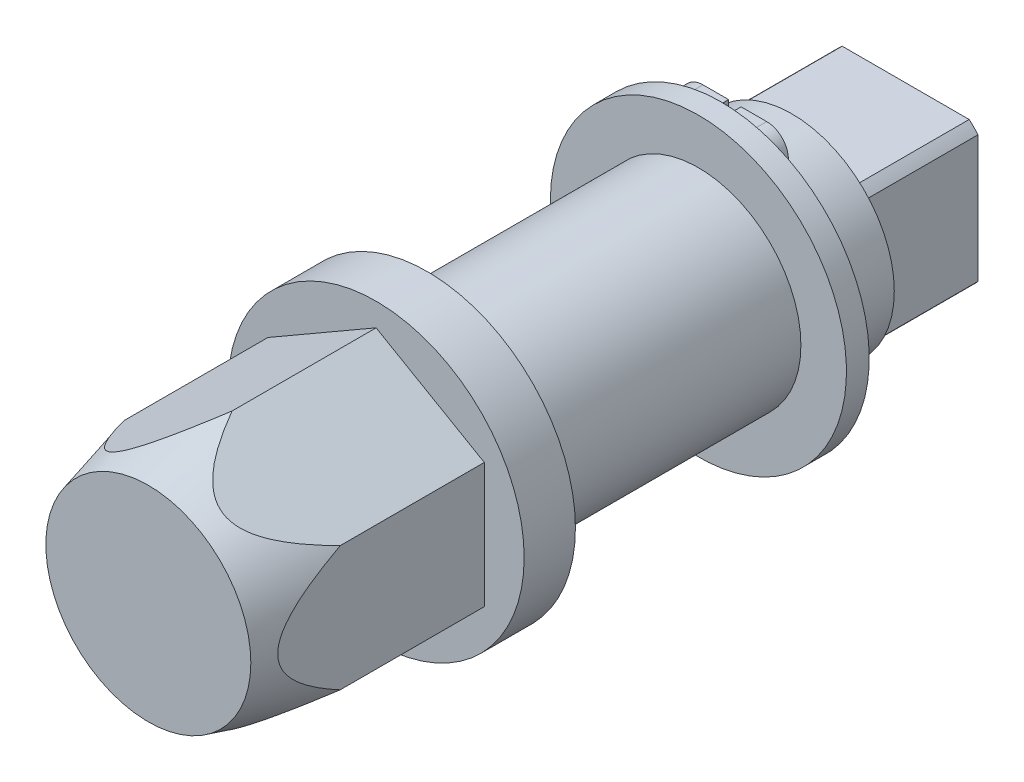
ISO-10303-21;
HEADER;
FILE_DESCRIPTION(('STEP AP214'),'2;1');
FILE_NAME('part.step','',(''),(''),'','','');
FILE_SCHEMA(('AUTOMOTIVE_DESIGN { 1 0 10303 214 1 1 1 1 }'));
ENDSEC;
DATA;
#1=APPLICATION_CONTEXT('core data for automotive mechanical design processes');
#2=APPLICATION_PROTOCOL_DEFINITION('international standard','automotive_design',2000,#1);
#3=PRODUCT_CONTEXT('',#1,'mechanical');
#4=PRODUCT('Part','Part','',(#3));
#5=PRODUCT_RELATED_PRODUCT_CATEGORY('part','',(#4));
#6=PRODUCT_DEFINITION_FORMATION('','',#4);
#7=PRODUCT_DEFINITION_CONTEXT('part definition',#1,'design');
#8=PRODUCT_DEFINITION('design','',#6,#7);
#9=PRODUCT_DEFINITION_SHAPE('','',#8);
#10=(LENGTH_UNIT() NAMED_UNIT(*) SI_UNIT(.MILLI.,.METRE.));
#11=(NAMED_UNIT(*) PLANE_ANGLE_UNIT() SI_UNIT($,.RADIAN.));
#12=(NAMED_UNIT(*) SI_UNIT($,.STERADIAN.) SOLID_ANGLE_UNIT());
#13=UNCERTAINTY_MEASURE_WITH_UNIT(LENGTH_MEASURE(1.E-05),#10,'distance_accuracy_value','');
#14=(GEOMETRIC_REPRESENTATION_CONTEXT(3) GLOBAL_UNCERTAINTY_ASSIGNED_CONTEXT((#13)) GLOBAL_UNIT_ASSIGNED_CONTEXT((#10,
#11,#12)) REPRESENTATION_CONTEXT('',''));
#15=CARTESIAN_POINT('',(0.,0.,0.));
#16=DIRECTION('',(0.,0.,1.));
#17=DIRECTION('',(1.,0.,0.));
#18=AXIS2_PLACEMENT_3D('',#15,#16,#17);
#19=CARTESIAN_POINT('',(0.,40.,-11.8));
#20=DIRECTION('',(0.,0.,-1.));
#21=DIRECTION('',(0.479360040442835,-0.877618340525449,0.));
#22=AXIS2_PLACEMENT_3D('',#19,#20,#21);
#23=CYLINDRICAL_SURFACE('',#22,13.);
#24=CARTESIAN_POINT('',(0.,40.,-11.8));
#25=DIRECTION('',(0.,0.,1.));
#26=DIRECTION('',(-0.479360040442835,0.877618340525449,0.));
#27=AXIS2_PLACEMENT_3D('',#24,#25,#26);
#28=CIRCLE('',#27,13.);
#29=CARTESIAN_POINT('',(-6.23168052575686,51.4090384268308,-11.8));
#30=VERTEX_POINT('',#29);
#31=EDGE_CURVE('E913',#30,#30,#28,.T.);
#32=ORIENTED_EDGE('',*,*,#31,.F.);
#33=EDGE_LOOP('',(#32));
#34=FACE_BOUND('',#33,.T.);
#35=CARTESIAN_POINT('',(0.,40.,-13.8));
#36=DIRECTION('',(0.,0.,1.));
#37=DIRECTION('',(-0.479360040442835,0.877618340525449,0.));
#38=AXIS2_PLACEMENT_3D('',#35,#36,#37);
#39=CIRCLE('',#38,13.);
#40=CARTESIAN_POINT('',(-6.23168052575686,51.4090384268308,-13.8));
#41=VERTEX_POINT('',#40);
#42=EDGE_CURVE('E912',#41,#41,#39,.T.);
#43=ORIENTED_EDGE('',*,*,#42,.T.);
#44=EDGE_LOOP('',(#43));
#45=FACE_BOUND('',#44,.T.);
#46=ADVANCED_FACE('F14',(#34,#45),#23,.T.);
#47=CARTESIAN_POINT('',(0.,40.,-11.8));
#48=DIRECTION('',(0.,0.,1.));
#49=DIRECTION('',(-0.479360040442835,0.877618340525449,0.));
#50=AXIS2_PLACEMENT_3D('',#47,#48,#49);
#51=PLANE('',#50);
#52=ORIENTED_EDGE('',*,*,#31,.T.);
#53=EDGE_LOOP('',(#52));
#54=FACE_BOUND('',#53,.T.);
#55=CARTESIAN_POINT('',(0.,40.,-11.8));
#56=DIRECTION('',(0.,0.,1.));
#57=DIRECTION('',(-0.479360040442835,0.877618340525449,0.));
#58=AXIS2_PLACEMENT_3D('',#55,#56,#57);
#59=CIRCLE('',#58,9.);
#60=CARTESIAN_POINT('',(-4.31424036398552,47.898565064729,-11.8));
#61=VERTEX_POINT('',#60);
#62=EDGE_CURVE('E914',#61,#61,#59,.T.);
#63=ORIENTED_EDGE('',*,*,#62,.F.);
#64=EDGE_LOOP('',(#63));
#65=FACE_BOUND('',#64,.T.);
#66=ADVANCED_FACE('F423',(#54,#65),#51,.T.);
#67=CARTESIAN_POINT('',(0.,40.,-13.8));
#68=DIRECTION('',(0.,0.,1.));
#69=DIRECTION('',(-0.479360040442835,0.877618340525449,0.));
#70=AXIS2_PLACEMENT_3D('',#67,#68,#69);
#71=PLANE('',#70);
#72=DIRECTION('',(0.,1.,0.));
#73=VECTOR('',#72,1.);
#74=CARTESIAN_POINT('',(0.549999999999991,40.,-13.8));
#75=LINE('',#74,#73);
#76=CARTESIAN_POINT('',(0.549999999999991,48.9831787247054,-13.8));
#77=VERTEX_POINT('',#76);
#78=CARTESIAN_POINT('',(0.549999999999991,52.3,-13.8));
#79=VERTEX_POINT('',#78);
#80=EDGE_CURVE('E9',#77,#79,#75,.T.);
#81=ORIENTED_EDGE('',*,*,#80,.F.);
#82=CARTESIAN_POINT('',(0.,40.,-13.8));
#83=DIRECTION('',(0.,0.,1.));
#84=DIRECTION('',(-0.479360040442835,0.877618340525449,0.));
#85=AXIS2_PLACEMENT_3D('',#82,#83,#84);
#86=CIRCLE('',#85,9.);
#87=CARTESIAN_POINT('',(-0.550000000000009,48.9831787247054,-13.8));
#88=VERTEX_POINT('',#87);
#89=EDGE_CURVE('E920',#77,#88,#86,.T.);
#90=ORIENTED_EDGE('',*,*,#89,.T.);
#91=DIRECTION('',(0.,-1.,0.));
#92=VECTOR('',#91,1.);
#93=CARTESIAN_POINT('',(-0.550000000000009,40.,-13.8));
#94=LINE('',#93,#92);
#95=CARTESIAN_POINT('',(-0.550000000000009,52.3,-13.8));
#96=VERTEX_POINT('',#95);
#97=EDGE_CURVE('E940',#96,#88,#94,.T.);
#98=ORIENTED_EDGE('',*,*,#97,.F.);
#99=DIRECTION('',(1.,0.,0.));
#100=VECTOR('',#99,1.);
#101=CARTESIAN_POINT('',(0.,52.3,-13.8));
#102=LINE('',#101,#100);
#103=CARTESIAN_POINT('',(-2.8,52.3,-13.8));
#104=VERTEX_POINT('',#103);
#105=EDGE_CURVE('E937',#104,#96,#102,.T.);
#106=ORIENTED_EDGE('',*,*,#105,.F.);
#107=CARTESIAN_POINT('',(-2.79999999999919,50.3999999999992,-13.8));
#108=DIRECTION('',(0.,0.,1.));
#109=DIRECTION('',(1.,0.,0.));
#110=AXIS2_PLACEMENT_3D('',#107,#108,#109);
#111=CIRCLE('',#110,1.90000000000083);
#112=CARTESIAN_POINT('',(-4.7,50.3999999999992,-13.8));
#113=VERTEX_POINT('',#112);
#114=EDGE_CURVE('E934',#113,#104,#111,.F.);
#115=ORIENTED_EDGE('',*,*,#114,.F.);
#116=DIRECTION('',(0.,1.,0.));
#117=VECTOR('',#116,1.);
#118=CARTESIAN_POINT('',(-4.7,40.,-13.8));
#119=LINE('',#118,#117);
#120=CARTESIAN_POINT('',(-4.7,49.7885104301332,-13.8));
#121=VERTEX_POINT('',#120);
#122=EDGE_CURVE('E932',#121,#113,#119,.T.);
#123=ORIENTED_EDGE('',*,*,#122,.F.);
#124=CARTESIAN_POINT('',(-6.59999999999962,49.788510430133,-13.8));
#125=DIRECTION('',(0.,0.,1.));
#126=DIRECTION('',(1.,0.,0.));
#127=AXIS2_PLACEMENT_3D('',#124,#125,#126);
#128=CIRCLE('',#127,1.8999999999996);
#129=CARTESIAN_POINT('',(-5.58461534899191,48.1825857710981,-13.8));
#130=VERTEX_POINT('',#129);
#131=EDGE_CURVE('E512',#130,#121,#128,.T.);
#132=ORIENTED_EDGE('',*,*,#131,.F.);
#133=CARTESIAN_POINT('',(0.,39.35,-13.8));
#134=DIRECTION('',(0.,0.,1.));
#135=DIRECTION('',(-1.,0.,0.));
#136=AXIS2_PLACEMENT_3D('',#133,#134,#135);
#137=CIRCLE('',#136,10.45);
#138=CARTESIAN_POINT('',(5.5846152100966,48.182585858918,-13.8));
#139=VERTEX_POINT('',#138);
#140=EDGE_CURVE('E539',#130,#139,#137,.T.);
#141=ORIENTED_EDGE('',*,*,#140,.T.);
#142=CARTESIAN_POINT('',(6.59999999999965,49.7885104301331,-13.8));
#143=DIRECTION('',(0.,0.,1.));
#144=DIRECTION('',(1.,0.,0.));
#145=AXIS2_PLACEMENT_3D('',#142,#143,#144);
#146=CIRCLE('',#145,1.89999999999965);
#147=CARTESIAN_POINT('',(4.7,49.7885104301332,-13.8));
#148=VERTEX_POINT('',#147);
#149=EDGE_CURVE('E542',#148,#139,#146,.T.);
#150=ORIENTED_EDGE('',*,*,#149,.F.);
#151=DIRECTION('',(0.,1.,0.));
#152=VECTOR('',#151,1.);
#153=CARTESIAN_POINT('',(4.7,49.7885104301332,-13.8));
#154=LINE('',#153,#152);
#155=CARTESIAN_POINT('',(4.7,50.4,-13.8));
#156=VERTEX_POINT('',#155);
#157=EDGE_CURVE('E543',#148,#156,#154,.T.);
#158=ORIENTED_EDGE('',*,*,#157,.T.);
#159=CARTESIAN_POINT('',(2.79999999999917,50.3999999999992,-13.8));
#160=DIRECTION('',(0.,0.,1.));
#161=DIRECTION('',(1.,0.,0.));
#162=AXIS2_PLACEMENT_3D('',#159,#160,#161);
#163=CIRCLE('',#162,1.90000000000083);
#164=CARTESIAN_POINT('',(2.8,52.3,-13.8));
#165=VERTEX_POINT('',#164);
#166=EDGE_CURVE('E546',#165,#156,#163,.F.);
#167=ORIENTED_EDGE('',*,*,#166,.F.);
#168=DIRECTION('',(-1.,0.,0.));
#169=VECTOR('',#168,1.);
#170=CARTESIAN_POINT('',(2.8,52.3,-13.8));
#171=LINE('',#170,#169);
#172=EDGE_CURVE('E24',#165,#79,#171,.T.);
#173=ORIENTED_EDGE('',*,*,#172,.T.);
#174=EDGE_LOOP('',(#81,#90,#98,#106,#115,#123,#132,#141,#150,#158,#167,#173));
#175=FACE_BOUND('',#174,.T.);
#176=ORIENTED_EDGE('',*,*,#42,.F.);
#177=EDGE_LOOP('',(#176));
#178=FACE_BOUND('',#177,.T.);
#179=ADVANCED_FACE('F429',(#175,#178),#71,.F.);
#180=CARTESIAN_POINT('',(0.,40.,-11.8));
#181=DIRECTION('',(0.,0.,-1.));
#182=DIRECTION('',(0.479360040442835,-0.877618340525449,0.));
#183=AXIS2_PLACEMENT_3D('',#180,#181,#182);
#184=CYLINDRICAL_SURFACE('',#183,9.);
#185=ORIENTED_EDGE('',*,*,#89,.F.);
#186=EDGE_CURVE('E575',#88,#77,#86,.T.);
#187=ORIENTED_EDGE('',*,*,#186,.F.);
#188=EDGE_LOOP('',(#185,#187));
#189=FACE_BOUND('',#188,.T.);
#190=CARTESIAN_POINT('',(0.,40.,-13.65));
#191=DIRECTION('',(0.,0.,1.));
#192=DIRECTION('',(0.,-1.,0.));
#193=AXIS2_PLACEMENT_3D('',#190,#191,#192);
#194=CIRCLE('',#193,9.);
#195=CARTESIAN_POINT('',(0.,31.,-13.65));
#196=VERTEX_POINT('',#195);
#197=EDGE_CURVE('E917',#196,#196,#194,.T.);
#198=ORIENTED_EDGE('',*,*,#197,.T.);
#199=EDGE_LOOP('',(#198));
#200=FACE_BOUND('',#199,.T.);
#201=ADVANCED_FACE('F602',(#189,#200),#184,.F.);
#202=CARTESIAN_POINT('',(2.35,50.4,-13.8));
#203=DIRECTION('',(0.,0.,1.));
#204=DIRECTION('',(1.,0.,0.));
#205=AXIS2_PLACEMENT_3D('',#202,#203,#204);
#206=CIRCLE('',#205,0.85);
#207=CARTESIAN_POINT('',(3.2,50.4,-13.8));
#208=VERTEX_POINT('',#207);
#209=EDGE_CURVE('E926',#208,#208,#206,.F.);
#210=ORIENTED_EDGE('',*,*,#209,.T.);
#211=EDGE_LOOP('',(#210));
#212=FACE_BOUND('',#211,.T.);
#213=ADVANCED_FACE('F592',(#212),#71,.F.);
#214=CARTESIAN_POINT('',(-2.35,50.4,-13.8));
#215=DIRECTION('',(0.,0.,1.));
#216=DIRECTION('',(1.,0.,0.));
#217=AXIS2_PLACEMENT_3D('',#214,#215,#216);
#218=CIRCLE('',#217,0.85);
#219=CARTESIAN_POINT('',(-1.5,50.4,-13.8));
#220=VERTEX_POINT('',#219);
#221=EDGE_CURVE('E929',#220,#220,#218,.F.);
#222=ORIENTED_EDGE('',*,*,#221,.T.);
#223=EDGE_LOOP('',(#222));
#224=FACE_BOUND('',#223,.T.);
#225=ADVANCED_FACE('F846',(#224),#71,.F.);
#226=CARTESIAN_POINT('',(0.,40.,-30.));
#227=DIRECTION('',(0.,0.,1.));
#228=DIRECTION('',(-1.,0.,0.));
#229=AXIS2_PLACEMENT_3D('',#226,#227,#228);
#230=PLANE('',#229);
#231=DIRECTION('',(0.,-1.,0.));
#232=VECTOR('',#231,1.);
#233=CARTESIAN_POINT('',(6.35,46.35,-30.));
#234=LINE('',#233,#232);
#235=CARTESIAN_POINT('',(6.35,45.5749439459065,-30.));
#236=VERTEX_POINT('',#235);
#237=CARTESIAN_POINT('',(6.35,34.4250560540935,-30.));
#238=VERTEX_POINT('',#237);
#239=EDGE_CURVE('E183',#236,#238,#234,.T.);
#240=ORIENTED_EDGE('',*,*,#239,.T.);
#241=CARTESIAN_POINT('',(0.,40.,-30.));
#242=DIRECTION('',(0.,0.,-1.));
#243=DIRECTION('',(1.,0.,0.));
#244=AXIS2_PLACEMENT_3D('',#241,#242,#243);
#245=CIRCLE('',#244,8.45);
#246=CARTESIAN_POINT('',(5.57494394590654,33.65,-30.));
#247=VERTEX_POINT('',#246);
#248=EDGE_CURVE('E18',#238,#247,#245,.T.);
#249=ORIENTED_EDGE('',*,*,#248,.T.);
#250=DIRECTION('',(-1.,0.,0.));
#251=VECTOR('',#250,1.);
#252=CARTESIAN_POINT('',(-6.35,33.65,-30.));
#253=LINE('',#252,#251);
#254=CARTESIAN_POINT('',(-5.57494394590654,33.65,-30.));
#255=VERTEX_POINT('',#254);
#256=EDGE_CURVE('E264',#247,#255,#253,.T.);
#257=ORIENTED_EDGE('',*,*,#256,.T.);
#258=CARTESIAN_POINT('',(-6.35,34.4250560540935,-30.));
#259=VERTEX_POINT('',#258);
#260=EDGE_CURVE('E405',#255,#259,#245,.T.);
#261=ORIENTED_EDGE('',*,*,#260,.T.);
#262=DIRECTION('',(0.,1.,0.));
#263=VECTOR('',#262,1.);
#264=CARTESIAN_POINT('',(-6.35,46.35,-30.));
#265=LINE('',#264,#263);
#266=CARTESIAN_POINT('',(-6.35,45.5749439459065,-30.));
#267=VERTEX_POINT('',#266);
#268=EDGE_CURVE('E376',#259,#267,#265,.T.);
#269=ORIENTED_EDGE('',*,*,#268,.T.);
#270=CARTESIAN_POINT('',(-5.57494394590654,46.35,-30.));
#271=VERTEX_POINT('',#270);
#272=EDGE_CURVE('E239',#267,#271,#245,.T.);
#273=ORIENTED_EDGE('',*,*,#272,.T.);
#274=DIRECTION('',(1.,0.,0.));
#275=VECTOR('',#274,1.);
#276=CARTESIAN_POINT('',(-6.35,46.35,-30.));
#277=LINE('',#276,#275);
#278=CARTESIAN_POINT('',(5.57494394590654,46.35,-30.));
#279=VERTEX_POINT('',#278);
#280=EDGE_CURVE('E268',#271,#279,#277,.T.);
#281=ORIENTED_EDGE('',*,*,#280,.T.);
#282=EDGE_CURVE('E233',#279,#236,#245,.T.);
#283=ORIENTED_EDGE('',*,*,#282,.T.);
#284=EDGE_LOOP('',(#240,#249,#257,#261,#269,#273,#281,#283));
#285=FACE_BOUND('',#284,.T.);
#286=ADVANCED_FACE('F16',(#285),#230,.F.);
#287=CARTESIAN_POINT('',(-6.35,33.65,17.1372481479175));
#288=DIRECTION('',(0.,-1.,0.));
#289=DIRECTION('',(1.,0.,0.));
#290=AXIS2_PLACEMENT_3D('',#287,#288,#289);
#291=PLANE('',#290);
#292=DIRECTION('',(0.,0.,-1.));
#293=VECTOR('',#292,1.);
#294=CARTESIAN_POINT('',(-5.57494394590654,33.65,-46.75));
#295=LINE('',#294,#293);
#296=CARTESIAN_POINT('',(-5.57494394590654,33.65,-20.));
#297=VERTEX_POINT('',#296);
#298=EDGE_CURVE('E390',#297,#255,#295,.T.);
#299=ORIENTED_EDGE('',*,*,#298,.T.);
#300=ORIENTED_EDGE('',*,*,#256,.F.);
#301=DIRECTION('',(0.,0.,-1.));
#302=VECTOR('',#301,1.);
#303=CARTESIAN_POINT('',(5.57494394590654,33.65,-46.75));
#304=LINE('',#303,#302);
#305=CARTESIAN_POINT('',(5.57494394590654,33.65,-20.));
#306=VERTEX_POINT('',#305);
#307=EDGE_CURVE('E386',#247,#306,#304,.F.);
#308=ORIENTED_EDGE('',*,*,#307,.T.);
#309=DIRECTION('',(-1.,0.,0.));
#310=VECTOR('',#309,1.);
#311=CARTESIAN_POINT('',(-6.35,33.65,-20.));
#312=LINE('',#311,#310);
#313=EDGE_CURVE('E383',#306,#297,#312,.T.);
#314=ORIENTED_EDGE('',*,*,#313,.T.);
#315=EDGE_LOOP('',(#299,#300,#308,#314));
#316=FACE_BOUND('',#315,.T.);
#317=ADVANCED_FACE('F342',(#316),#291,.T.);
#318=CARTESIAN_POINT('',(0.,40.,-46.75));
#319=DIRECTION('',(0.,0.,-1.));
#320=DIRECTION('',(1.,0.,0.));
#321=AXIS2_PLACEMENT_3D('',#318,#319,#320);
#322=CYLINDRICAL_SURFACE('',#321,8.45);
#323=DIRECTION('',(0.,0.,-1.));
#324=VECTOR('',#323,1.);
#325=CARTESIAN_POINT('',(-6.35,34.4250560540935,-46.75));
#326=LINE('',#325,#324);
#327=CARTESIAN_POINT('',(-6.35,34.4250560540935,-20.));
#328=VERTEX_POINT('',#327);
#329=EDGE_CURVE('E273',#259,#328,#326,.F.);
#330=ORIENTED_EDGE('',*,*,#329,.F.);
#331=ORIENTED_EDGE('',*,*,#260,.F.);
#332=ORIENTED_EDGE('',*,*,#298,.F.);
#333=CARTESIAN_POINT('',(0.,40.,-20.));
#334=DIRECTION('',(0.,0.,-1.));
#335=DIRECTION('',(1.,0.,0.));
#336=AXIS2_PLACEMENT_3D('',#333,#334,#335);
#337=CIRCLE('',#336,8.45);
#338=EDGE_CURVE('E234',#297,#328,#337,.T.);
#339=ORIENTED_EDGE('',*,*,#338,.T.);
#340=EDGE_LOOP('',(#330,#331,#332,#339));
#341=FACE_BOUND('',#340,.T.);
#342=ADVANCED_FACE('F398',(#341),#322,.T.);
#343=CARTESIAN_POINT('',(-6.35,46.35,17.1372481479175));
#344=DIRECTION('',(-1.,0.,0.));
#345=DIRECTION('',(0.,0.,-1.));
#346=AXIS2_PLACEMENT_3D('',#343,#344,#345);
#347=PLANE('',#346);
#348=DIRECTION('',(0.,0.,-1.));
#349=VECTOR('',#348,1.);
#350=CARTESIAN_POINT('',(-6.35,45.5749439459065,-46.75));
#351=LINE('',#350,#349);
#352=CARTESIAN_POINT('',(-6.35,45.5749439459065,-20.));
#353=VERTEX_POINT('',#352);
#354=EDGE_CURVE('E256',#353,#267,#351,.T.);
#355=ORIENTED_EDGE('',*,*,#354,.T.);
#356=ORIENTED_EDGE('',*,*,#268,.F.);
#357=ORIENTED_EDGE('',*,*,#329,.T.);
#358=DIRECTION('',(0.,1.,0.));
#359=VECTOR('',#358,1.);
#360=CARTESIAN_POINT('',(-6.35,46.35,-20.));
#361=LINE('',#360,#359);
#362=EDGE_CURVE('E260',#328,#353,#361,.T.);
#363=ORIENTED_EDGE('',*,*,#362,.T.);
#364=EDGE_LOOP('',(#355,#356,#357,#363));
#365=FACE_BOUND('',#364,.T.);
#366=ADVANCED_FACE('F393',(#365),#347,.T.);
#367=DIRECTION('',(0.,0.,-1.));
#368=VECTOR('',#367,1.);
#369=CARTESIAN_POINT('',(-5.57494394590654,46.35,-46.75));
#370=LINE('',#369,#368);
#371=CARTESIAN_POINT('',(-5.57494394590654,46.35,-20.));
#372=VERTEX_POINT('',#371);
#373=EDGE_CURVE('E254',#271,#372,#370,.F.);
#374=ORIENTED_EDGE('',*,*,#373,.F.);
#375=ORIENTED_EDGE('',*,*,#272,.F.);
#376=ORIENTED_EDGE('',*,*,#354,.F.);
#377=EDGE_CURVE('E241',#353,#372,#337,.T.);
#378=ORIENTED_EDGE('',*,*,#377,.T.);
#379=EDGE_LOOP('',(#374,#375,#376,#378));
#380=FACE_BOUND('',#379,.T.);
#381=ADVANCED_FACE('F251',(#380),#322,.T.);
#382=CARTESIAN_POINT('',(-6.35,46.35,17.1372481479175));
#383=DIRECTION('',(0.,1.,0.));
#384=DIRECTION('',(-1.,0.,0.));
#385=AXIS2_PLACEMENT_3D('',#382,#383,#384);
#386=PLANE('',#385);
#387=DIRECTION('',(0.,0.,-1.));
#388=VECTOR('',#387,1.);
#389=CARTESIAN_POINT('',(5.57494394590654,46.35,-46.75));
#390=LINE('',#389,#388);
#391=CARTESIAN_POINT('',(5.57494394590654,46.35,-20.));
#392=VERTEX_POINT('',#391);
#393=EDGE_CURVE('E269',#392,#279,#390,.T.);
#394=ORIENTED_EDGE('',*,*,#393,.T.);
#395=ORIENTED_EDGE('',*,*,#280,.F.);
#396=ORIENTED_EDGE('',*,*,#373,.T.);
#397=DIRECTION('',(1.,0.,0.));
#398=VECTOR('',#397,1.);
#399=CARTESIAN_POINT('',(-6.35,46.35,-20.));
#400=LINE('',#399,#398);
#401=EDGE_CURVE('E262',#372,#392,#400,.T.);
#402=ORIENTED_EDGE('',*,*,#401,.T.);
#403=EDGE_LOOP('',(#394,#395,#396,#402));
#404=FACE_BOUND('',#403,.T.);
#405=ADVANCED_FACE('F266',(#404),#386,.T.);
#406=DIRECTION('',(0.,0.,-1.));
#407=VECTOR('',#406,1.);
#408=CARTESIAN_POINT('',(6.35,45.5749439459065,-46.75));
#409=LINE('',#408,#407);
#410=CARTESIAN_POINT('',(6.35,45.5749439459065,-20.));
#411=VERTEX_POINT('',#410);
#412=EDGE_CURVE('E271',#236,#411,#409,.F.);
#413=ORIENTED_EDGE('',*,*,#412,.F.);
#414=ORIENTED_EDGE('',*,*,#282,.F.);
#415=ORIENTED_EDGE('',*,*,#393,.F.);
#416=EDGE_CURVE('E230',#392,#411,#337,.T.);
#417=ORIENTED_EDGE('',*,*,#416,.T.);
#418=EDGE_LOOP('',(#413,#414,#415,#417));
#419=FACE_BOUND('',#418,.T.);
#420=ADVANCED_FACE('F410',(#419),#322,.T.);
#421=CARTESIAN_POINT('',(6.35,46.35,17.1372481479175));
#422=DIRECTION('',(1.,0.,0.));
#423=DIRECTION('',(0.,0.,1.));
#424=AXIS2_PLACEMENT_3D('',#421,#422,#423);
#425=PLANE('',#424);
#426=DIRECTION('',(0.,0.,-1.));
#427=VECTOR('',#426,1.);
#428=CARTESIAN_POINT('',(6.35,34.4250560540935,-46.75));
#429=LINE('',#428,#427);
#430=CARTESIAN_POINT('',(6.35,34.4250560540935,-20.));
#431=VERTEX_POINT('',#430);
#432=EDGE_CURVE('E278',#431,#238,#429,.T.);
#433=ORIENTED_EDGE('',*,*,#432,.T.);
#434=ORIENTED_EDGE('',*,*,#239,.F.);
#435=ORIENTED_EDGE('',*,*,#412,.T.);
#436=DIRECTION('',(0.,-1.,0.));
#437=VECTOR('',#436,1.);
#438=CARTESIAN_POINT('',(6.35,46.35,-20.));
#439=LINE('',#438,#437);
#440=EDGE_CURVE('E168',#411,#431,#439,.T.);
#441=ORIENTED_EDGE('',*,*,#440,.T.);
#442=EDGE_LOOP('',(#433,#434,#435,#441));
#443=FACE_BOUND('',#442,.T.);
#444=ADVANCED_FACE('F412',(#443),#425,.T.);
#445=ORIENTED_EDGE('',*,*,#432,.F.);
#446=EDGE_CURVE('E231',#431,#306,#337,.T.);
#447=ORIENTED_EDGE('',*,*,#446,.T.);
#448=ORIENTED_EDGE('',*,*,#307,.F.);
#449=ORIENTED_EDGE('',*,*,#248,.F.);
#450=EDGE_LOOP('',(#445,#447,#448,#449));
#451=FACE_BOUND('',#450,.T.);
#452=ADVANCED_FACE('F402',(#451),#322,.T.);
#453=CARTESIAN_POINT('',(0.,31.55,-20.));
#454=DIRECTION('',(0.,0.,1.));
#455=DIRECTION('',(-1.,0.,0.));
#456=AXIS2_PLACEMENT_3D('',#453,#454,#455);
#457=PLANE('',#456);
#458=ORIENTED_EDGE('',*,*,#446,.F.);
#459=ORIENTED_EDGE('',*,*,#440,.F.);
#460=ORIENTED_EDGE('',*,*,#416,.F.);
#461=ORIENTED_EDGE('',*,*,#401,.F.);
#462=ORIENTED_EDGE('',*,*,#377,.F.);
#463=ORIENTED_EDGE('',*,*,#362,.F.);
#464=ORIENTED_EDGE('',*,*,#338,.F.);
#465=ORIENTED_EDGE('',*,*,#313,.F.);
#466=EDGE_LOOP('',(#458,#459,#460,#461,#462,#463,#464,#465));
#467=FACE_BOUND('',#466,.T.);
#468=CARTESIAN_POINT('',(0.,40.,-20.));
#469=DIRECTION('',(0.,0.,-1.));
#470=DIRECTION('',(1.,0.,0.));
#471=AXIS2_PLACEMENT_3D('',#468,#469,#470);
#472=CIRCLE('',#471,9.);
#473=CARTESIAN_POINT('',(9.,40.,-20.));
#474=VERTEX_POINT('',#473);
#475=EDGE_CURVE('E228',#474,#474,#472,.T.);
#476=ORIENTED_EDGE('',*,*,#475,.T.);
#477=EDGE_LOOP('',(#476));
#478=FACE_BOUND('',#477,.T.);
#479=ADVANCED_FACE('F257',(#467,#478),#457,.F.);
#480=CARTESIAN_POINT('',(0.,40.,-46.75));
#481=DIRECTION('',(0.,0.,-1.));
#482=DIRECTION('',(1.,0.,0.));
#483=AXIS2_PLACEMENT_3D('',#480,#481,#482);
#484=CYLINDRICAL_SURFACE('',#483,9.);
#485=ORIENTED_EDGE('',*,*,#475,.F.);
#486=EDGE_LOOP('',(#485));
#487=FACE_BOUND('',#486,.T.);
#488=CARTESIAN_POINT('',(0.,40.,-15.));
#489=DIRECTION('',(0.,0.,-1.));
#490=DIRECTION('',(1.,0.,0.));
#491=AXIS2_PLACEMENT_3D('',#488,#489,#490);
#492=CIRCLE('',#491,9.);
#493=CARTESIAN_POINT('',(-0.550000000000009,48.9831787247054,-15.));
#494=VERTEX_POINT('',#493);
#495=CARTESIAN_POINT('',(0.549999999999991,48.9831787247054,-15.));
#496=VERTEX_POINT('',#495);
#497=EDGE_CURVE('E225',#494,#496,#492,.T.);
#498=ORIENTED_EDGE('',*,*,#497,.T.);
#499=CARTESIAN_POINT('',(0.,40.,-15.));
#500=DIRECTION('',(0.,0.,-1.));
#501=DIRECTION('',(-1.,0.,0.));
#502=AXIS2_PLACEMENT_3D('',#499,#500,#501);
#503=CIRCLE('',#502,9.);
#504=EDGE_CURVE('E573',#494,#496,#503,.F.);
#505=ORIENTED_EDGE('',*,*,#504,.F.);
#506=EDGE_LOOP('',(#498,#505));
#507=FACE_BOUND('',#506,.T.);
#508=ADVANCED_FACE('F492',(#487,#507),#484,.T.);
#509=CARTESIAN_POINT('',(0.,39.35,-13.8));
#510=DIRECTION('',(0.,0.,-1.));
#511=DIRECTION('',(1.,0.,0.));
#512=AXIS2_PLACEMENT_3D('',#509,#510,#511);
#513=CYLINDRICAL_SURFACE('',#512,10.45);
#514=DIRECTION('',(0.,0.,-1.));
#515=VECTOR('',#514,1.);
#516=CARTESIAN_POINT('',(-5.58461534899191,48.1825857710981,-13.8));
#517=LINE('',#516,#515);
#518=CARTESIAN_POINT('',(-5.58461534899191,48.1825857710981,-15.));
#519=VERTEX_POINT('',#518);
#520=EDGE_CURVE('E571',#130,#519,#517,.T.);
#521=ORIENTED_EDGE('',*,*,#520,.T.);
#522=CARTESIAN_POINT('',(0.,39.35,-15.));
#523=DIRECTION('',(0.,0.,1.));
#524=DIRECTION('',(-1.,0.,0.));
#525=AXIS2_PLACEMENT_3D('',#522,#523,#524);
#526=CIRCLE('',#525,10.45);
#527=CARTESIAN_POINT('',(5.5846152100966,48.182585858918,-15.));
#528=VERTEX_POINT('',#527);
#529=EDGE_CURVE('E526',#519,#528,#526,.T.);
#530=ORIENTED_EDGE('',*,*,#529,.T.);
#531=DIRECTION('',(0.,0.,-1.));
#532=VECTOR('',#531,1.);
#533=CARTESIAN_POINT('',(5.5846152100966,48.182585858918,-13.8));
#534=LINE('',#533,#532);
#535=EDGE_CURVE('E569',#139,#528,#534,.T.);
#536=ORIENTED_EDGE('',*,*,#535,.F.);
#537=ORIENTED_EDGE('',*,*,#140,.F.);
#538=EDGE_LOOP('',(#521,#530,#536,#537));
#539=FACE_BOUND('',#538,.T.);
#540=ADVANCED_FACE('F489',(#539),#513,.T.);
#541=CARTESIAN_POINT('',(6.59999999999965,49.7885104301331,-13.8));
#542=DIRECTION('',(0.,0.,-1.));
#543=DIRECTION('',(1.,0.,0.));
#544=AXIS2_PLACEMENT_3D('',#541,#542,#543);
#545=CYLINDRICAL_SURFACE('',#544,1.89999999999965);
#546=ORIENTED_EDGE('',*,*,#535,.T.);
#547=CARTESIAN_POINT('',(6.59999999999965,49.7885104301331,-15.));
#548=DIRECTION('',(0.,0.,-1.));
#549=DIRECTION('',(1.,0.,0.));
#550=AXIS2_PLACEMENT_3D('',#547,#548,#549);
#551=CIRCLE('',#550,1.89999999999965);
#552=CARTESIAN_POINT('',(4.7,49.7885104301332,-15.));
#553=VERTEX_POINT('',#552);
#554=EDGE_CURVE('E951',#528,#553,#551,.T.);
#555=ORIENTED_EDGE('',*,*,#554,.T.);
#556=DIRECTION('',(0.,0.,-1.));
#557=VECTOR('',#556,1.);
#558=CARTESIAN_POINT('',(4.7,49.7885104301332,-13.8));
#559=LINE('',#558,#557);
#560=EDGE_CURVE('E567',#148,#553,#559,.T.);
#561=ORIENTED_EDGE('',*,*,#560,.F.);
#562=ORIENTED_EDGE('',*,*,#149,.T.);
#563=EDGE_LOOP('',(#546,#555,#561,#562));
#564=FACE_BOUND('',#563,.T.);
#565=ADVANCED_FACE('F486',(#564),#545,.F.);
#566=CARTESIAN_POINT('',(4.7,49.7885104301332,-13.8));
#567=DIRECTION('',(-1.,0.,0.));
#568=DIRECTION('',(0.,0.,-1.));
#569=AXIS2_PLACEMENT_3D('',#566,#567,#568);
#570=PLANE('',#569);
#571=ORIENTED_EDGE('',*,*,#560,.T.);
#572=DIRECTION('',(0.,1.,0.));
#573=VECTOR('',#572,1.);
#574=CARTESIAN_POINT('',(4.7,49.7885104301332,-15.));
#575=LINE('',#574,#573);
#576=CARTESIAN_POINT('',(4.7,50.4,-15.));
#577=VERTEX_POINT('',#576);
#578=EDGE_CURVE('E954',#553,#577,#575,.T.);
#579=ORIENTED_EDGE('',*,*,#578,.T.);
#580=DIRECTION('',(0.,0.,-1.));
#581=VECTOR('',#580,1.);
#582=CARTESIAN_POINT('',(4.7,50.4,-13.8));
#583=LINE('',#582,#581);
#584=EDGE_CURVE('E565',#156,#577,#583,.T.);
#585=ORIENTED_EDGE('',*,*,#584,.F.);
#586=ORIENTED_EDGE('',*,*,#157,.F.);
#587=EDGE_LOOP('',(#571,#579,#585,#586));
#588=FACE_BOUND('',#587,.T.);
#589=ADVANCED_FACE('F482',(#588),#570,.F.);
#590=CARTESIAN_POINT('',(2.79999999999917,50.3999999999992,-13.8));
#591=DIRECTION('',(0.,0.,-1.));
#592=DIRECTION('',(1.,0.,0.));
#593=AXIS2_PLACEMENT_3D('',#590,#591,#592);
#594=CYLINDRICAL_SURFACE('',#593,1.90000000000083);
#595=ORIENTED_EDGE('',*,*,#584,.T.);
#596=CARTESIAN_POINT('',(2.79999999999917,50.3999999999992,-15.));
#597=DIRECTION('',(0.,0.,1.));
#598=DIRECTION('',(-1.,0.,0.));
#599=AXIS2_PLACEMENT_3D('',#596,#597,#598);
#600=CIRCLE('',#599,1.90000000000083);
#601=CARTESIAN_POINT('',(2.8,52.3,-15.));
#602=VERTEX_POINT('',#601);
#603=EDGE_CURVE('E957',#577,#602,#600,.T.);
#604=ORIENTED_EDGE('',*,*,#603,.T.);
#605=DIRECTION('',(0.,0.,-1.));
#606=VECTOR('',#605,1.);
#607=CARTESIAN_POINT('',(2.8,52.3,-13.8));
#608=LINE('',#607,#606);
#609=EDGE_CURVE('E563',#165,#602,#608,.T.);
#610=ORIENTED_EDGE('',*,*,#609,.F.);
#611=ORIENTED_EDGE('',*,*,#166,.T.);
#612=EDGE_LOOP('',(#595,#604,#610,#611));
#613=FACE_BOUND('',#612,.T.);
#614=ADVANCED_FACE('F478',(#613),#594,.T.);
#615=CARTESIAN_POINT('',(2.8,52.3,-13.8));
#616=DIRECTION('',(0.,-1.,0.));
#617=DIRECTION('',(1.,0.,0.));
#618=AXIS2_PLACEMENT_3D('',#615,#616,#617);
#619=PLANE('',#618);
#620=ORIENTED_EDGE('',*,*,#609,.T.);
#621=DIRECTION('',(-1.,0.,0.));
#622=VECTOR('',#621,1.);
#623=CARTESIAN_POINT('',(2.8,52.3,-15.));
#624=LINE('',#623,#622);
#625=CARTESIAN_POINT('',(0.549999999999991,52.3,-15.));
#626=VERTEX_POINT('',#625);
#627=EDGE_CURVE('E960',#602,#626,#624,.T.);
#628=ORIENTED_EDGE('',*,*,#627,.T.);
#629=DIRECTION('',(0.,0.,-1.));
#630=VECTOR('',#629,1.);
#631=CARTESIAN_POINT('',(0.549999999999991,52.3,-13.8));
#632=LINE('',#631,#630);
#633=EDGE_CURVE('E561',#79,#626,#632,.T.);
#634=ORIENTED_EDGE('',*,*,#633,.F.);
#635=ORIENTED_EDGE('',*,*,#172,.F.);
#636=EDGE_LOOP('',(#620,#628,#634,#635));
#637=FACE_BOUND('',#636,.T.);
#638=ADVANCED_FACE('F475',(#637),#619,.F.);
#639=CARTESIAN_POINT('',(0.,31.,-15.));
#640=DIRECTION('',(0.,0.,-1.));
#641=DIRECTION('',(1.,0.,0.));
#642=AXIS2_PLACEMENT_3D('',#639,#640,#641);
#643=PLANE('',#642);
#644=CARTESIAN_POINT('',(0.,40.,-15.));
#645=DIRECTION('',(0.,0.,-1.));
#646=DIRECTION('',(1.,0.,0.));
#647=AXIS2_PLACEMENT_3D('',#644,#645,#646);
#648=CIRCLE('',#647,8.5);
#649=CARTESIAN_POINT('',(-0.550000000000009,48.4821872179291,-15.));
#650=VERTEX_POINT('',#649);
#651=CARTESIAN_POINT('',(0.549999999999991,48.4821872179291,-15.));
#652=VERTEX_POINT('',#651);
#653=EDGE_CURVE('E222',#650,#652,#648,.T.);
#654=ORIENTED_EDGE('',*,*,#653,.T.);
#655=DIRECTION('',(0.,-1.,0.));
#656=VECTOR('',#655,1.);
#657=CARTESIAN_POINT('',(0.549999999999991,52.3,-15.));
#658=LINE('',#657,#656);
#659=EDGE_CURVE('E963',#496,#652,#658,.T.);
#660=ORIENTED_EDGE('',*,*,#659,.F.);
#661=ORIENTED_EDGE('',*,*,#497,.F.);
#662=DIRECTION('',(0.,1.,0.));
#663=VECTOR('',#662,1.);
#664=CARTESIAN_POINT('',(-0.550000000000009,48.4821872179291,-15.));
#665=LINE('',#664,#663);
#666=EDGE_CURVE('E968',#650,#494,#665,.T.);
#667=ORIENTED_EDGE('',*,*,#666,.F.);
#668=EDGE_LOOP('',(#654,#660,#661,#667));
#669=FACE_BOUND('',#668,.T.);
#670=ADVANCED_FACE('F420',(#669),#643,.F.);
#671=CARTESIAN_POINT('',(-0.550000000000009,48.4821872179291,-13.8));
#672=DIRECTION('',(-1.,0.,0.));
#673=DIRECTION('',(0.,0.,-1.));
#674=AXIS2_PLACEMENT_3D('',#671,#672,#673);
#675=PLANE('',#674);
#676=DIRECTION('',(0.,0.,-1.));
#677=VECTOR('',#676,1.);
#678=CARTESIAN_POINT('',(-0.550000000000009,48.4821872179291,-13.8));
#679=LINE('',#678,#677);
#680=CARTESIAN_POINT('',(-0.550000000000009,48.4821872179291,-13.8));
#681=VERTEX_POINT('',#680);
#682=EDGE_CURVE('E557',#681,#650,#679,.T.);
#683=ORIENTED_EDGE('',*,*,#682,.T.);
#684=ORIENTED_EDGE('',*,*,#666,.T.);
#685=CARTESIAN_POINT('',(-0.550000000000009,52.3,-15.));
#686=VERTEX_POINT('',#685);
#687=EDGE_CURVE('E967',#494,#686,#665,.T.);
#688=ORIENTED_EDGE('',*,*,#687,.T.);
#689=DIRECTION('',(0.,0.,-1.));
#690=VECTOR('',#689,1.);
#691=CARTESIAN_POINT('',(-0.550000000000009,52.3,-13.8));
#692=LINE('',#691,#690);
#693=EDGE_CURVE('E554',#96,#686,#692,.T.);
#694=ORIENTED_EDGE('',*,*,#693,.F.);
#695=ORIENTED_EDGE('',*,*,#97,.T.);
#696=DIRECTION('',(0.,1.,0.));
#697=VECTOR('',#696,1.);
#698=CARTESIAN_POINT('',(-0.550000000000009,48.4821872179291,-13.8));
#699=LINE('',#698,#697);
#700=EDGE_CURVE('E516',#681,#88,#699,.T.);
#701=ORIENTED_EDGE('',*,*,#700,.F.);
#702=EDGE_LOOP('',(#683,#684,#688,#694,#695,#701));
#703=FACE_BOUND('',#702,.T.);
#704=ADVANCED_FACE('F466',(#703),#675,.F.);
#705=CARTESIAN_POINT('',(0.,40.,-46.75));
#706=DIRECTION('',(0.,0.,-1.));
#707=DIRECTION('',(1.,0.,0.));
#708=AXIS2_PLACEMENT_3D('',#705,#706,#707);
#709=CYLINDRICAL_SURFACE('',#708,8.5);
#710=CARTESIAN_POINT('',(0.,40.,-13.65));
#711=DIRECTION('',(0.,0.,-1.));
#712=DIRECTION('',(1.,0.,0.));
#713=AXIS2_PLACEMENT_3D('',#710,#711,#712);
#714=CIRCLE('',#713,8.5);
#715=CARTESIAN_POINT('',(8.5,40.,-13.65));
#716=VERTEX_POINT('',#715);
#717=EDGE_CURVE('E219',#716,#716,#714,.T.);
#718=ORIENTED_EDGE('',*,*,#717,.T.);
#719=EDGE_LOOP('',(#718));
#720=FACE_BOUND('',#719,.T.);
#721=CARTESIAN_POINT('',(0.,40.,-13.8));
#722=DIRECTION('',(0.,0.,-1.));
#723=DIRECTION('',(1.,0.,0.));
#724=AXIS2_PLACEMENT_3D('',#721,#722,#723);
#725=CIRCLE('',#724,8.5);
#726=CARTESIAN_POINT('',(0.549999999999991,48.4821872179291,-13.8));
#727=VERTEX_POINT('',#726);
#728=EDGE_CURVE('E533',#727,#681,#725,.T.);
#729=ORIENTED_EDGE('',*,*,#728,.F.);
#730=DIRECTION('',(0.,0.,-1.));
#731=VECTOR('',#730,1.);
#732=CARTESIAN_POINT('',(0.549999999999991,48.4821872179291,-13.8));
#733=LINE('',#732,#731);
#734=EDGE_CURVE('E559',#727,#652,#733,.T.);
#735=ORIENTED_EDGE('',*,*,#734,.T.);
#736=ORIENTED_EDGE('',*,*,#653,.F.);
#737=ORIENTED_EDGE('',*,*,#682,.F.);
#738=EDGE_LOOP('',(#729,#735,#736,#737));
#739=FACE_BOUND('',#738,.T.);
#740=ADVANCED_FACE('F469',(#720,#739),#709,.T.);
#741=CARTESIAN_POINT('',(0.,31.5,-13.65));
#742=DIRECTION('',(0.,0.,1.));
#743=DIRECTION('',(-1.,0.,0.));
#744=AXIS2_PLACEMENT_3D('',#741,#742,#743);
#745=PLANE('',#744);
#746=ORIENTED_EDGE('',*,*,#717,.F.);
#747=EDGE_LOOP('',(#746));
#748=FACE_BOUND('',#747,.T.);
#749=ORIENTED_EDGE('',*,*,#197,.F.);
#750=EDGE_LOOP('',(#749));
#751=FACE_BOUND('',#750,.T.);
#752=ADVANCED_FACE('F473',(#748,#751),#745,.F.);
#753=CARTESIAN_POINT('',(0.549999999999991,52.3,-13.8));
#754=DIRECTION('',(1.,0.,0.));
#755=DIRECTION('',(0.,0.,1.));
#756=AXIS2_PLACEMENT_3D('',#753,#754,#755);
#757=PLANE('',#756);
#758=ORIENTED_EDGE('',*,*,#633,.T.);
#759=EDGE_CURVE('E964',#626,#496,#658,.T.);
#760=ORIENTED_EDGE('',*,*,#759,.T.);
#761=ORIENTED_EDGE('',*,*,#659,.T.);
#762=ORIENTED_EDGE('',*,*,#734,.F.);
#763=DIRECTION('',(0.,-1.,0.));
#764=VECTOR('',#763,1.);
#765=CARTESIAN_POINT('',(0.549999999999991,52.3,-13.8));
#766=LINE('',#765,#764);
#767=EDGE_CURVE('E530',#77,#727,#766,.T.);
#768=ORIENTED_EDGE('',*,*,#767,.F.);
#769=ORIENTED_EDGE('',*,*,#80,.T.);
#770=EDGE_LOOP('',(#758,#760,#761,#762,#768,#769));
#771=FACE_BOUND('',#770,.T.);
#772=ADVANCED_FACE('F454',(#771),#757,.F.);
#773=CARTESIAN_POINT('',(-6.59999999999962,49.788510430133,-13.8));
#774=DIRECTION('',(0.,0.,-1.));
#775=DIRECTION('',(1.,0.,0.));
#776=AXIS2_PLACEMENT_3D('',#773,#774,#775);
#777=PLANE('',#776);
#778=ORIENTED_EDGE('',*,*,#186,.T.);
#779=ORIENTED_EDGE('',*,*,#767,.T.);
#780=ORIENTED_EDGE('',*,*,#728,.T.);
#781=ORIENTED_EDGE('',*,*,#700,.T.);
#782=EDGE_LOOP('',(#778,#779,#780,#781));
#783=FACE_BOUND('',#782,.T.);
#784=ADVANCED_FACE('F441',(#783),#777,.F.);
#785=CARTESIAN_POINT('',(-0.550000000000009,52.3,-13.8));
#786=DIRECTION('',(0.,-1.,0.));
#787=DIRECTION('',(1.,0.,0.));
#788=AXIS2_PLACEMENT_3D('',#785,#786,#787);
#789=PLANE('',#788);
#790=ORIENTED_EDGE('',*,*,#693,.T.);
#791=DIRECTION('',(-1.,0.,0.));
#792=VECTOR('',#791,1.);
#793=CARTESIAN_POINT('',(-0.550000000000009,52.3,-15.));
#794=LINE('',#793,#792);
#795=CARTESIAN_POINT('',(-2.8,52.3,-15.));
#796=VERTEX_POINT('',#795);
#797=EDGE_CURVE('E535',#686,#796,#794,.T.);
#798=ORIENTED_EDGE('',*,*,#797,.T.);
#799=DIRECTION('',(0.,0.,-1.));
#800=VECTOR('',#799,1.);
#801=CARTESIAN_POINT('',(-2.8,52.3,-13.8));
#802=LINE('',#801,#800);
#803=EDGE_CURVE('E552',#104,#796,#802,.T.);
#804=ORIENTED_EDGE('',*,*,#803,.F.);
#805=ORIENTED_EDGE('',*,*,#105,.T.);
#806=EDGE_LOOP('',(#790,#798,#804,#805));
#807=FACE_BOUND('',#806,.T.);
#808=ADVANCED_FACE('F453',(#807),#789,.F.);
#809=CARTESIAN_POINT('',(-6.59999999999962,49.788510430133,-13.8));
#810=DIRECTION('',(0.,0.,-1.));
#811=DIRECTION('',(1.,0.,0.));
#812=AXIS2_PLACEMENT_3D('',#809,#810,#811);
#813=CYLINDRICAL_SURFACE('',#812,1.8999999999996);
#814=DIRECTION('',(0.,0.,-1.));
#815=VECTOR('',#814,1.);
#816=CARTESIAN_POINT('',(-4.7,49.7885104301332,-13.8));
#817=LINE('',#816,#815);
#818=CARTESIAN_POINT('',(-4.7,49.7885104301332,-15.));
#819=VERTEX_POINT('',#818);
#820=EDGE_CURVE('E506',#121,#819,#817,.T.);
#821=ORIENTED_EDGE('',*,*,#820,.T.);
#822=CARTESIAN_POINT('',(-6.59999999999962,49.788510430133,-15.));
#823=DIRECTION('',(0.,0.,-1.));
#824=DIRECTION('',(1.,0.,0.));
#825=AXIS2_PLACEMENT_3D('',#822,#823,#824);
#826=CIRCLE('',#825,1.8999999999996);
#827=EDGE_CURVE('E509',#819,#519,#826,.T.);
#828=ORIENTED_EDGE('',*,*,#827,.T.);
#829=ORIENTED_EDGE('',*,*,#520,.F.);
#830=ORIENTED_EDGE('',*,*,#131,.T.);
#831=EDGE_LOOP('',(#821,#828,#829,#830));
#832=FACE_BOUND('',#831,.T.);
#833=ADVANCED_FACE('F340',(#832),#813,.F.);
#834=CARTESIAN_POINT('',(-6.59999999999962,49.788510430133,-15.));
#835=DIRECTION('',(0.,0.,-1.));
#836=DIRECTION('',(1.,0.,0.));
#837=AXIS2_PLACEMENT_3D('',#834,#835,#836);
#838=PLANE('',#837);
#839=CARTESIAN_POINT('',(2.35,50.4,-15.));
#840=DIRECTION('',(0.,0.,1.));
#841=DIRECTION('',(-1.,0.,0.));
#842=AXIS2_PLACEMENT_3D('',#839,#840,#841);
#843=CIRCLE('',#842,0.85);
#844=CARTESIAN_POINT('',(1.5,50.4,-15.));
#845=VERTEX_POINT('',#844);
#846=EDGE_CURVE('E404',#845,#845,#843,.T.);
#847=ORIENTED_EDGE('',*,*,#846,.T.);
#848=EDGE_LOOP('',(#847));
#849=FACE_BOUND('',#848,.T.);
#850=CARTESIAN_POINT('',(-2.35,50.4,-15.));
#851=DIRECTION('',(0.,0.,1.));
#852=DIRECTION('',(-1.,0.,0.));
#853=AXIS2_PLACEMENT_3D('',#850,#851,#852);
#854=CIRCLE('',#853,0.85);
#855=CARTESIAN_POINT('',(-3.2,50.4,-15.));
#856=VERTEX_POINT('',#855);
#857=EDGE_CURVE('E407',#856,#856,#854,.T.);
#858=ORIENTED_EDGE('',*,*,#857,.T.);
#859=EDGE_LOOP('',(#858));
#860=FACE_BOUND('',#859,.T.);
#861=ORIENTED_EDGE('',*,*,#687,.F.);
#862=ORIENTED_EDGE('',*,*,#504,.T.);
#863=ORIENTED_EDGE('',*,*,#759,.F.);
#864=ORIENTED_EDGE('',*,*,#627,.F.);
#865=ORIENTED_EDGE('',*,*,#603,.F.);
#866=ORIENTED_EDGE('',*,*,#578,.F.);
#867=ORIENTED_EDGE('',*,*,#554,.F.);
#868=ORIENTED_EDGE('',*,*,#529,.F.);
#869=ORIENTED_EDGE('',*,*,#827,.F.);
#870=DIRECTION('',(0.,-1.,0.));
#871=VECTOR('',#870,1.);
#872=CARTESIAN_POINT('',(-4.7,50.4,-15.));
#873=LINE('',#872,#871);
#874=CARTESIAN_POINT('',(-4.7,50.3999999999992,-15.));
#875=VERTEX_POINT('',#874);
#876=EDGE_CURVE('E523',#875,#819,#873,.T.);
#877=ORIENTED_EDGE('',*,*,#876,.F.);
#878=CARTESIAN_POINT('',(-2.79999999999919,50.3999999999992,-15.));
#879=DIRECTION('',(0.,0.,1.));
#880=DIRECTION('',(-1.,0.,0.));
#881=AXIS2_PLACEMENT_3D('',#878,#879,#880);
#882=CIRCLE('',#881,1.90000000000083);
#883=EDGE_CURVE('E531',#796,#875,#882,.T.);
#884=ORIENTED_EDGE('',*,*,#883,.F.);
#885=ORIENTED_EDGE('',*,*,#797,.F.);
#886=EDGE_LOOP('',(#861,#862,#863,#864,#865,#866,#867,#868,#869,#877,#884,#885));
#887=FACE_BOUND('',#886,.T.);
#888=ADVANCED_FACE('F436',(#849,#860,#887),#838,.T.);
#889=CARTESIAN_POINT('',(2.35,50.4,-13.8));
#890=DIRECTION('',(0.,0.,-1.));
#891=DIRECTION('',(1.,0.,0.));
#892=AXIS2_PLACEMENT_3D('',#889,#890,#891);
#893=CYLINDRICAL_SURFACE('',#892,0.85);
#894=ORIENTED_EDGE('',*,*,#209,.F.);
#895=EDGE_LOOP('',(#894));
#896=FACE_BOUND('',#895,.T.);
#897=ORIENTED_EDGE('',*,*,#846,.F.);
#898=EDGE_LOOP('',(#897));
#899=FACE_BOUND('',#898,.T.);
#900=ADVANCED_FACE('F439',(#896,#899),#893,.F.);
#901=CARTESIAN_POINT('',(-2.35,50.4,-13.8));
#902=DIRECTION('',(0.,0.,-1.));
#903=DIRECTION('',(1.,0.,0.));
#904=AXIS2_PLACEMENT_3D('',#901,#902,#903);
#905=CYLINDRICAL_SURFACE('',#904,0.85);
#906=ORIENTED_EDGE('',*,*,#221,.F.);
#907=EDGE_LOOP('',(#906));
#908=FACE_BOUND('',#907,.T.);
#909=ORIENTED_EDGE('',*,*,#857,.F.);
#910=EDGE_LOOP('',(#909));
#911=FACE_BOUND('',#910,.T.);
#912=ADVANCED_FACE('F444',(#908,#911),#905,.F.);
#913=CARTESIAN_POINT('',(-2.79999999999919,50.3999999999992,-13.8));
#914=DIRECTION('',(0.,0.,-1.));
#915=DIRECTION('',(1.,0.,0.));
#916=AXIS2_PLACEMENT_3D('',#913,#914,#915);
#917=CYLINDRICAL_SURFACE('',#916,1.90000000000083);
#918=ORIENTED_EDGE('',*,*,#803,.T.);
#919=ORIENTED_EDGE('',*,*,#883,.T.);
#920=DIRECTION('',(0.,0.,-1.));
#921=VECTOR('',#920,1.);
#922=CARTESIAN_POINT('',(-4.7,50.3999999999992,-13.8));
#923=LINE('',#922,#921);
#924=EDGE_CURVE('E515',#113,#875,#923,.T.);
#925=ORIENTED_EDGE('',*,*,#924,.F.);
#926=ORIENTED_EDGE('',*,*,#114,.T.);
#927=EDGE_LOOP('',(#918,#919,#925,#926));
#928=FACE_BOUND('',#927,.T.);
#929=ADVANCED_FACE('F448',(#928),#917,.T.);
#930=CARTESIAN_POINT('',(-4.7,50.4,-13.8));
#931=DIRECTION('',(1.,0.,0.));
#932=DIRECTION('',(0.,0.,1.));
#933=AXIS2_PLACEMENT_3D('',#930,#931,#932);
#934=PLANE('',#933);
#935=ORIENTED_EDGE('',*,*,#924,.T.);
#936=ORIENTED_EDGE('',*,*,#876,.T.);
#937=ORIENTED_EDGE('',*,*,#820,.F.);
#938=ORIENTED_EDGE('',*,*,#122,.T.);
#939=EDGE_LOOP('',(#935,#936,#937,#938));
#940=FACE_BOUND('',#939,.T.);
#941=ADVANCED_FACE('F450',(#940),#934,.F.);
#942=CARTESIAN_POINT('',(0.,27.5,36.5));
#943=DIRECTION('',(0.,0.,-1.));
#944=DIRECTION('',(1.,0.,0.));
#945=AXIS2_PLACEMENT_3D('',#942,#943,#944);
#946=PLANE('',#945);
#947=CARTESIAN_POINT('',(0.,40.,36.5));
#948=DIRECTION('',(0.,0.,-1.));
#949=DIRECTION('',(1.,0.,0.));
#950=AXIS2_PLACEMENT_3D('',#947,#948,#949);
#951=CIRCLE('',#950,9.);
#952=CARTESIAN_POINT('',(9.,40.,36.5));
#953=VERTEX_POINT('',#952);
#954=EDGE_CURVE('E194',#953,#953,#951,.T.);
#955=ORIENTED_EDGE('',*,*,#954,.F.);
#956=EDGE_LOOP('',(#955));
#957=FACE_BOUND('',#956,.T.);
#958=ADVANCED_FACE('F338',(#957),#946,.F.);
#959=CARTESIAN_POINT('',(0.,40.,29.1491470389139));
#960=DIRECTION('',(0.,0.,-1.));
#961=DIRECTION('',(1.,0.,0.));
#962=AXIS2_PLACEMENT_3D('',#959,#960,#961);
#963=CONICAL_SURFACE('',#962,10.9696551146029,0.261799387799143);
#964=ORIENTED_EDGE('',*,*,#954,.T.);
#965=EDGE_LOOP('',(#964));
#966=FACE_BOUND('',#965,.T.);
#967=CARTESIAN_POINT('',(9.50009281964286,34.5152260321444,29.1489470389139));
#968=CARTESIAN_POINT('',(9.43664753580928,34.4785958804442,29.2856463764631));
#969=CARTESIAN_POINT('',(9.37246865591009,34.4415421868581,29.4218905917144));
#970=CARTESIAN_POINT('',(9.24247379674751,34.3664896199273,29.6933482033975));
#971=CARTESIAN_POINT('',(9.17665767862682,34.3284906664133,29.8285615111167));
#972=CARTESIAN_POINT('',(8.97627482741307,34.2127995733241,30.2329238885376));
#973=CARTESIAN_POINT('',(8.83900075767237,34.1335443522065,30.5003024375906));
#974=CARTESIAN_POINT('',(8.55386163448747,33.9689192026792,31.031840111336));
#975=CARTESIAN_POINT('',(8.40589040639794,33.8834879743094,31.2959236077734));
#976=CARTESIAN_POINT('',(8.09845725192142,33.7059913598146,31.8148633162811));
#977=CARTESIAN_POINT('',(7.93900461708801,33.6139313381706,32.0697267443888));
#978=CARTESIAN_POINT('',(7.69318850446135,33.4720093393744,32.4349353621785));
#979=CARTESIAN_POINT('',(7.61268216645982,33.4255289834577,32.5505403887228));
#980=CARTESIAN_POINT('',(7.4477882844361,33.3303274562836,32.7780404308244));
#981=CARTESIAN_POINT('',(7.36340029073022,33.2816060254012,32.8899350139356));
#982=CARTESIAN_POINT('',(7.19024490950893,33.1816347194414,33.1090133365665));
#983=CARTESIAN_POINT('',(7.10148036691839,33.1303864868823,33.216200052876));
#984=CARTESIAN_POINT('',(6.91889195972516,33.0249690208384,33.424631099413));
#985=CARTESIAN_POINT('',(6.82506914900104,32.9708003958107,33.5258766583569));
#986=CARTESIAN_POINT('',(6.57670498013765,32.8274072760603,33.776159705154));
#987=CARTESIAN_POINT('',(6.41791696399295,32.7357309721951,33.9197198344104));
#988=CARTESIAN_POINT('',(6.0836335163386,32.5427323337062,34.1781228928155));
#989=CARTESIAN_POINT('',(5.90818867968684,32.4414392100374,34.2930491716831));
#990=CARTESIAN_POINT('',(5.60140840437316,32.264319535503,34.4485029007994));
#991=CARTESIAN_POINT('',(5.47471870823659,32.191175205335,34.5010643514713));
#992=CARTESIAN_POINT('',(5.21559157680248,32.0415680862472,34.581593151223));
#993=CARTESIAN_POINT('',(5.0831620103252,31.9651098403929,34.6095931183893));
#994=CARTESIAN_POINT('',(4.81525960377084,31.8104363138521,34.6375722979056));
#995=CARTESIAN_POINT('',(4.67977375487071,31.7322135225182,34.6373915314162));
#996=CARTESIAN_POINT('',(4.41109642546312,31.5770925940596,34.6086418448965));
#997=CARTESIAN_POINT('',(4.27790639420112,31.5001952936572,34.5800556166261));
#998=CARTESIAN_POINT('',(3.99003069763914,31.333990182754,34.4894926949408));
#999=CARTESIAN_POINT('',(3.83673716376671,31.2454861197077,34.4217445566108));
#1000=CARTESIAN_POINT('',(3.54141049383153,31.0749791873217,34.2590687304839));
#1001=CARTESIAN_POINT('',(3.39940400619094,30.9929917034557,34.1640790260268));
#1002=CARTESIAN_POINT('',(3.14183289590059,30.8442829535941,33.9666536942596));
#1003=CARTESIAN_POINT('',(3.0250848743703,30.7768784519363,33.8662259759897));
#1004=CARTESIAN_POINT('',(2.79938490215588,30.6465705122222,33.6541963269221));
#1005=CARTESIAN_POINT('',(2.69044006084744,30.5836711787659,33.5425844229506));
#1006=CARTESIAN_POINT('',(2.47865450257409,30.4613967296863,33.310311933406));
#1007=CARTESIAN_POINT('',(2.37586208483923,30.4020494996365,33.1895932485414));
#1008=CARTESIAN_POINT('',(2.17625035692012,30.286803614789,32.9418793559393));
#1009=CARTESIAN_POINT('',(2.07942867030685,30.2309035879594,32.8148866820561));
#1010=CARTESIAN_POINT('',(1.88524732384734,30.1187929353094,32.5483200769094));
#1011=CARTESIAN_POINT('',(1.78819736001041,30.0627611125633,32.4084469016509));
#1012=CARTESIAN_POINT('',(1.59892821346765,29.9534865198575,32.1243936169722));
#1013=CARTESIAN_POINT('',(1.50670993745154,29.9002442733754,31.9802127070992));
#1014=CARTESIAN_POINT('',(1.23602377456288,29.7439635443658,31.5422195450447));
#1015=CARTESIAN_POINT('',(1.06376290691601,29.644508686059,31.2432937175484));
#1016=CARTESIAN_POINT('',(0.7378865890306,29.4563639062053,30.6477355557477));
#1017=CARTESIAN_POINT('',(0.583816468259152,29.3674114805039,30.3514296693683));
#1018=CARTESIAN_POINT('',(0.35978762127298,29.2380683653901,29.9029441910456));
#1019=CARTESIAN_POINT('',(0.28640535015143,29.1957010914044,29.7530271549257));
#1020=CARTESIAN_POINT('',(0.141683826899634,29.1121460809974,29.4519078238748));
#1021=CARTESIAN_POINT('',(0.0703443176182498,29.07095819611,29.3007056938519));
#1022=CARTESIAN_POINT('',(-9.28196430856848E-05,29.0302912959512,29.1489470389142));
#1023=B_SPLINE_CURVE_WITH_KNOTS('',3,(#967,#968,#969,#970,#971,#972,#973,#974,#975,#976,#977,
#978,#979,#980,#981,#982,#983,#984,#985,#986,#987,#988,#989,#990,#991,#992,#993,#994,#995,#996,
#997,#998,#999,#1000,#1001,#1002,#1003,#1004,#1005,#1006,#1007,#1008,#1009,#1010,#1011,#1012,
#1013,#1014,#1015,#1016,#1017,#1018,#1019,#1020,#1021,#1022),.UNSPECIFIED.,.F.,.F.,(4,2,2,2,2,2,
2,2,2,2,2,2,2,2,2,2,2,2,2,2,2,2,2,2,2,2,2,4),(0.,0.465271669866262,0.930582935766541,
1.86288009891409,2.80621835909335,3.74880160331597,4.19374668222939,4.63874343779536,
5.08345464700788,5.5280735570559,6.22496409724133,6.91980172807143,7.38441639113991,
7.84841309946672,8.31504396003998,8.7819593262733,9.34736634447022,9.91407089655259,
10.417652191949,10.921686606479,11.4292645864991,11.9366392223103,12.4741532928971,
13.011767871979,14.0882991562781,15.1248861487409,15.6414873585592,16.1580232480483),.UNSPECIFIED.);
#1024=CARTESIAN_POINT('',(9.5,34.5151724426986,29.1491470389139));
#1025=VERTEX_POINT('',#1024);
#1026=CARTESIAN_POINT('',(0.,29.0303448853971,29.1491470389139));
#1027=VERTEX_POINT('',#1026);
#1028=EDGE_CURVE('E176',#1025,#1027,#1023,.T.);
#1029=ORIENTED_EDGE('',*,*,#1028,.F.);
#1030=CARTESIAN_POINT('',(9.5,50.5930853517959,16.9852353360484));
#1031=CARTESIAN_POINT('',(9.5,50.3867862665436,17.5582720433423));
#1032=CARTESIAN_POINT('',(9.5,50.1781960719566,18.1304959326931));
#1033=CARTESIAN_POINT('',(9.5,49.7553161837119,19.2729685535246));
#1034=CARTESIAN_POINT('',(9.5,49.541025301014,19.8432168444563));
#1035=CARTESIAN_POINT('',(9.5,49.103829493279,20.9860699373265));
#1036=CARTESIAN_POINT('',(9.5,48.8808660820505,21.5586524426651));
#1037=CARTESIAN_POINT('',(9.5,48.426567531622,22.7003990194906));
#1038=CARTESIAN_POINT('',(9.5,48.1952335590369,23.2695635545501));
#1039=CARTESIAN_POINT('',(9.5,47.6963864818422,24.4651862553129));
#1040=CARTESIAN_POINT('',(9.5,47.4276738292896,25.0911483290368));
#1041=CARTESIAN_POINT('',(9.5,47.0117602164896,26.0245512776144));
#1042=CARTESIAN_POINT('',(9.5,46.8709448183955,26.3348389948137));
#1043=CARTESIAN_POINT('',(9.5,46.5843063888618,26.953088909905));
#1044=CARTESIAN_POINT('',(9.5,46.4384835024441,27.2610511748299));
#1045=CARTESIAN_POINT('',(9.5,46.1415186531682,27.8728776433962));
#1046=CARTESIAN_POINT('',(9.5,45.9904004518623,28.176753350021));
#1047=CARTESIAN_POINT('',(9.5,45.6811324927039,28.7808941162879));
#1048=CARTESIAN_POINT('',(9.5,45.5229832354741,29.0811594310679));
#1049=CARTESIAN_POINT('',(9.5,45.1982205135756,29.676791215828));
#1050=CARTESIAN_POINT('',(9.5,45.0316137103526,29.9721613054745));
#1051=CARTESIAN_POINT('',(9.5,44.6877594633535,30.5566144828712));
#1052=CARTESIAN_POINT('',(9.5,44.5105147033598,30.8456991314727));
#1053=CARTESIAN_POINT('',(9.5,44.2584714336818,31.2355351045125));
#1054=CARTESIAN_POINT('',(9.5,44.1895511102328,31.3400955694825));
#1055=CARTESIAN_POINT('',(9.5,44.0496437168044,31.5478279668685));
#1056=CARTESIAN_POINT('',(9.5,43.9786565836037,31.6509998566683));
#1057=CARTESIAN_POINT('',(9.5,43.7621982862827,31.9582448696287));
#1058=CARTESIAN_POINT('',(9.5,43.6133011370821,32.1599365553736));
#1059=CARTESIAN_POINT('',(9.5,43.3057063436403,32.5526715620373));
#1060=CARTESIAN_POINT('',(9.5,43.1471158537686,32.7437981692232));
#1061=CARTESIAN_POINT('',(9.5,42.8161952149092,33.1136485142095));
#1062=CARTESIAN_POINT('',(9.5,42.6438790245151,33.2923845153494));
#1063=CARTESIAN_POINT('',(9.5,42.3171328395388,33.5983747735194));
#1064=CARTESIAN_POINT('',(9.5,42.1657769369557,33.7288679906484));
#1065=CARTESIAN_POINT('',(9.5,41.8494365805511,33.9730093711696));
#1066=CARTESIAN_POINT('',(9.5,41.6844308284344,34.0866304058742));
#1067=CARTESIAN_POINT('',(9.5,41.3365493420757,34.29060023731));
#1068=CARTESIAN_POINT('',(9.5,41.1534398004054,34.3805684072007));
#1069=CARTESIAN_POINT('',(9.5,40.8686684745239,34.4878056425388));
#1070=CARTESIAN_POINT('',(9.5,40.7721844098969,34.5189110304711));
#1071=CARTESIAN_POINT('',(9.5,40.576470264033,34.5706280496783));
#1072=CARTESIAN_POINT('',(9.5,40.4772416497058,34.5912451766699));
#1073=CARTESIAN_POINT('',(9.5,40.231365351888,34.627603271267));
#1074=CARTESIAN_POINT('',(9.5,40.0836886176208,34.6368552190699));
#1075=CARTESIAN_POINT('',(9.5,39.7889821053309,34.6295017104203));
#1076=CARTESIAN_POINT('',(9.5,39.6419525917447,34.6128865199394));
#1077=CARTESIAN_POINT('',(9.5,39.353476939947,34.5560201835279));
#1078=CARTESIAN_POINT('',(9.5,39.2120056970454,34.5158926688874));
#1079=CARTESIAN_POINT('',(9.5,38.9362681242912,34.4160947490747));
#1080=CARTESIAN_POINT('',(9.5,38.8020038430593,34.3564188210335));
#1081=CARTESIAN_POINT('',(9.5,38.5542599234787,34.2283999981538));
#1082=CARTESIAN_POINT('',(9.5,38.4400315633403,34.1614747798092));
#1083=CARTESIAN_POINT('',(9.5,38.2178498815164,34.0178286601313));
#1084=CARTESIAN_POINT('',(9.5,38.109901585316,33.9411000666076));
#1085=CARTESIAN_POINT('',(9.5,37.8994986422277,33.7797145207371));
#1086=CARTESIAN_POINT('',(9.5,37.7970668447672,33.6950280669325));
#1087=CARTESIAN_POINT('',(9.5,37.5975808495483,33.5196470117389));
#1088=CARTESIAN_POINT('',(9.5,37.5005250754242,33.4289541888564));
#1089=CARTESIAN_POINT('',(9.5,37.2658543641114,33.1982569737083));
#1090=CARTESIAN_POINT('',(9.5,37.1310388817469,33.0554114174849));
#1091=CARTESIAN_POINT('',(9.5,36.8699701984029,32.7620515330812));
#1092=CARTESIAN_POINT('',(9.5,36.7437218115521,32.6115329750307));
#1093=CARTESIAN_POINT('',(9.5,36.4982092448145,32.3044804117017));
#1094=CARTESIAN_POINT('',(9.5,36.3789583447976,32.1479358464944));
#1095=CARTESIAN_POINT('',(9.5,36.1465382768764,31.8303893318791));
#1096=CARTESIAN_POINT('',(9.5,36.0333698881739,31.669386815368));
#1097=CARTESIAN_POINT('',(9.5,35.8109284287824,31.3419762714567));
#1098=CARTESIAN_POINT('',(9.5,35.701716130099,31.1755271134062));
#1099=CARTESIAN_POINT('',(9.5,35.4878361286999,30.8397339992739));
#1100=CARTESIAN_POINT('',(9.5,35.3831686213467,30.6703899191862));
#1101=CARTESIAN_POINT('',(9.5,35.1779042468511,30.3295608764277));
#1102=CARTESIAN_POINT('',(9.5,35.077302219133,30.1580790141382));
#1103=CARTESIAN_POINT('',(9.5,34.8795372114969,29.8131585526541));
#1104=CARTESIAN_POINT('',(9.5,34.7823740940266,29.6397200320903));
#1105=CARTESIAN_POINT('',(9.5,34.4574133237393,29.0477669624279));
#1106=CARTESIAN_POINT('',(9.5,34.2367294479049,28.625341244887));
#1107=CARTESIAN_POINT('',(9.5,33.8083699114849,27.7739194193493));
#1108=CARTESIAN_POINT('',(9.5,33.6006967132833,27.3449220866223));
#1109=CARTESIAN_POINT('',(9.5,33.1954710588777,26.4818863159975));
#1110=CARTESIAN_POINT('',(9.5,32.9979245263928,26.0478451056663));
#1111=CARTESIAN_POINT('',(9.5,32.6110627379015,25.1761064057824));
#1112=CARTESIAN_POINT('',(9.5,32.4217477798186,24.7384087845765));
#1113=CARTESIAN_POINT('',(9.5,32.0492864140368,23.8587559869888));
#1114=CARTESIAN_POINT('',(9.5,31.8661616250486,23.4167916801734));
#1115=CARTESIAN_POINT('',(9.5,31.505586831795,22.5305513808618));
#1116=CARTESIAN_POINT('',(9.5,31.328136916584,22.0862753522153));
#1117=CARTESIAN_POINT('',(9.5,30.9781041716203,21.1959980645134));
#1118=CARTESIAN_POINT('',(9.5,30.8055196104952,20.7499974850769));
#1119=CARTESIAN_POINT('',(9.5,30.4644646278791,19.8564246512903));
#1120=CARTESIAN_POINT('',(9.5,30.2959942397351,19.4088523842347));
#1121=CARTESIAN_POINT('',(9.5,29.8336718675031,18.165705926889));
#1122=CARTESIAN_POINT('',(9.5,29.5436256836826,17.3687160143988));
#1123=CARTESIAN_POINT('',(9.5,28.9723121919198,15.7715157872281));
#1124=CARTESIAN_POINT('',(9.5,28.6910457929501,14.9713051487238));
#1125=CARTESIAN_POINT('',(9.5,28.1373651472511,13.3733796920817));
#1126=CARTESIAN_POINT('',(9.5,27.8649068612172,12.5756801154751));
#1127=CARTESIAN_POINT('',(9.5,27.4605978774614,11.3777208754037));
#1128=CARTESIAN_POINT('',(9.5,27.3265673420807,10.9781946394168));
#1129=CARTESIAN_POINT('',(9.5,27.0598387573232,10.1786991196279));
#1130=CARTESIAN_POINT('',(9.5,26.9271407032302,9.77872983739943));
#1131=CARTESIAN_POINT('',(9.5,26.7950483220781,9.37856047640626));
#1132=B_SPLINE_CURVE_WITH_KNOTS('',3,(#1030,#1031,#1032,#1033,#1034,#1035,#1036,#1037,#1038,
#1039,#1040,#1041,#1042,#1043,#1044,#1045,#1046,#1047,#1048,#1049,#1050,#1051,#1052,#1053,#1054,
#1055,#1056,#1057,#1058,#1059,#1060,#1061,#1062,#1063,#1064,#1065,#1066,#1067,#1068,#1069,#1070,
#1071,#1072,#1073,#1074,#1075,#1076,#1077,#1078,#1079,#1080,#1081,#1082,#1083,#1084,#1085,#1086,
#1087,#1088,#1089,#1090,#1091,#1092,#1093,#1094,#1095,#1096,#1097,#1098,#1099,#1100,#1101,#1102,
#1103,#1104,#1105,#1106,#1107,#1108,#1109,#1110,#1111,#1112,#1113,#1114,#1115,#1116,#1117,#1118,
#1119,#1120,#1121,#1122,#1123,#1124,#1125,#1126,#1127,#1128,#1129,#1130,#1131),.UNSPECIFIED.,
.F.,.F.,(4,2,2,2,2,2,2,2,2,2,2,2,2,2,2,2,2,2,2,2,2,2,2,2,2,2,2,2,2,2,2,2,2,2,2,2,2,2,2,2,2,2,2,
2,2,2,2,2,2,2,4),(0.,1.82713326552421,3.65465066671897,5.49797926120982,7.34105193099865,
9.38443436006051,10.4066360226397,11.4288081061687,12.4468675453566,13.4648546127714,
14.4820519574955,15.4989937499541,15.874666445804,16.2503506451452,17.0021133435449,
17.7466979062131,18.490534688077,19.0891789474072,19.6887755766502,20.2975003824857,
20.6011206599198,20.9045816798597,21.3461445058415,21.7878735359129,22.227300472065,
22.6668516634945,23.0634308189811,23.460323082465,23.8587495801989,24.2570586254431,
24.8458435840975,25.434956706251,26.0251539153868,26.615426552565,27.2125787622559,
27.8097566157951,28.4061509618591,29.00252142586,30.431961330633,31.8616709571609,
33.2922075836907,34.7227959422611,36.1579506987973,37.593127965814,39.0277878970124,
40.4624594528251,43.006767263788,45.5513376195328,48.0801468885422,49.3443715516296,
50.6085917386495),.UNSPECIFIED.);
#1133=CARTESIAN_POINT('',(9.5,45.4848275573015,29.1491470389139));
#1134=VERTEX_POINT('',#1133);
#1135=EDGE_CURVE('E193',#1134,#1025,#1132,.T.);
#1136=ORIENTED_EDGE('',*,*,#1135,.F.);
#1137=CARTESIAN_POINT('',(-9.28196428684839E-05,50.9697087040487,29.1489470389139));
#1138=CARTESIAN_POINT('',(0.0633524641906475,50.9330785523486,29.285646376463));
#1139=CARTESIAN_POINT('',(0.127531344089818,50.8960248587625,29.4218905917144));
#1140=CARTESIAN_POINT('',(0.257526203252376,50.8209722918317,29.6933482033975));
#1141=CARTESIAN_POINT('',(0.32334232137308,50.7829733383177,29.8285615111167));
#1142=CARTESIAN_POINT('',(0.523725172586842,50.6672822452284,30.2329238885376));
#1143=CARTESIAN_POINT('',(0.660999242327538,50.5880270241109,30.5003024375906));
#1144=CARTESIAN_POINT('',(0.946138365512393,50.4234018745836,31.031840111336));
#1145=CARTESIAN_POINT('',(1.09410959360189,50.3379706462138,31.2959236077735));
#1146=CARTESIAN_POINT('',(1.40154274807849,50.160474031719,31.8148633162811));
#1147=CARTESIAN_POINT('',(1.56099538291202,50.0684140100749,32.0697267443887));
#1148=CARTESIAN_POINT('',(1.80681149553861,49.9264920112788,32.4349353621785));
#1149=CARTESIAN_POINT('',(1.88731783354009,49.8800116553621,32.5505403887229));
#1150=CARTESIAN_POINT('',(2.05221171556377,49.784810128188,32.7780404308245));
#1151=CARTESIAN_POINT('',(2.13659970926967,49.7360886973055,32.8899350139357));
#1152=CARTESIAN_POINT('',(2.30975509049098,49.6361173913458,33.1090133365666));
#1153=CARTESIAN_POINT('',(2.3985196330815,49.5848691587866,33.2162000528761));
#1154=CARTESIAN_POINT('',(2.58110804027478,49.4794516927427,33.4246310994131));
#1155=CARTESIAN_POINT('',(2.67493085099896,49.425283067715,33.525876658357));
#1156=CARTESIAN_POINT('',(2.92329501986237,49.2818899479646,33.776159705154));
#1157=CARTESIAN_POINT('',(3.08208303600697,49.1902136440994,33.9197198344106));
#1158=CARTESIAN_POINT('',(3.41636648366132,48.9972150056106,34.1781228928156));
#1159=CARTESIAN_POINT('',(3.59181132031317,48.8959218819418,34.293049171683));
#1160=CARTESIAN_POINT('',(3.89859159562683,48.7188022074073,34.4485029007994));
#1161=CARTESIAN_POINT('',(4.02528129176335,48.6456578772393,34.5010643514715));
#1162=CARTESIAN_POINT('',(4.28440842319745,48.4960507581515,34.5815931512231));
#1163=CARTESIAN_POINT('',(4.41683798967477,48.4195925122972,34.6095931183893));
#1164=CARTESIAN_POINT('',(4.68474039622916,48.2649189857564,34.6375722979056));
#1165=CARTESIAN_POINT('',(4.82022624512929,48.1866961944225,34.6373915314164));
#1166=CARTESIAN_POINT('',(5.08890357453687,48.0315752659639,34.6086418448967));
#1167=CARTESIAN_POINT('',(5.22209360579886,47.9546779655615,34.5800556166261));
#1168=CARTESIAN_POINT('',(5.50996930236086,47.7884728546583,34.4894926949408));
#1169=CARTESIAN_POINT('',(5.66326283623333,47.6999687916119,34.4217445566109));
#1170=CARTESIAN_POINT('',(5.9585895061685,47.529461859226,34.2590687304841));
#1171=CARTESIAN_POINT('',(6.10059599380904,47.4474743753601,34.1640790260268));
#1172=CARTESIAN_POINT('',(6.35816710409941,47.2987656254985,33.9666536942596));
#1173=CARTESIAN_POINT('',(6.47491512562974,47.2313611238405,33.8662259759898));
#1174=CARTESIAN_POINT('',(6.7006150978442,47.1010531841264,33.6541963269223));
#1175=CARTESIAN_POINT('',(6.80955993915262,47.0381538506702,33.5425844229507));
#1176=CARTESIAN_POINT('',(7.02134549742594,46.9158794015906,33.3103119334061));
#1177=CARTESIAN_POINT('',(7.12413791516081,46.8565321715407,33.1895932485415));
#1178=CARTESIAN_POINT('',(7.3237496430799,46.7412862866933,32.9418793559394));
#1179=CARTESIAN_POINT('',(7.42057132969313,46.6853862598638,32.8148866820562));
#1180=CARTESIAN_POINT('',(7.61475267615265,46.5732756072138,32.5483200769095));
#1181=CARTESIAN_POINT('',(7.71180263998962,46.5172437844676,32.4084469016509));
#1182=CARTESIAN_POINT('',(7.90107178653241,46.4079691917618,32.1243936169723));
#1183=CARTESIAN_POINT('',(7.9932900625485,46.3547269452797,31.9802127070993));
#1184=CARTESIAN_POINT('',(8.26397622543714,46.1984462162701,31.5422195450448));
#1185=CARTESIAN_POINT('',(8.43623709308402,46.0989913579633,31.2432937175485));
#1186=CARTESIAN_POINT('',(8.76211341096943,45.9108465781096,30.6477355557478));
#1187=CARTESIAN_POINT('',(8.91618353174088,45.8218941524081,30.3514296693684));
#1188=CARTESIAN_POINT('',(9.14021237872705,45.6925510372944,29.9029441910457));
#1189=CARTESIAN_POINT('',(9.21359464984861,45.6501837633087,29.7530271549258));
#1190=CARTESIAN_POINT('',(9.35831617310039,45.5666287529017,29.4519078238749));
#1191=CARTESIAN_POINT('',(9.42965568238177,45.5254408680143,29.300705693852));
#1192=CARTESIAN_POINT('',(9.50009281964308,45.4847739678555,29.1489470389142));
#1193=B_SPLINE_CURVE_WITH_KNOTS('',3,(#1137,#1138,#1139,#1140,#1141,#1142,#1143,#1144,#1145,
#1146,#1147,#1148,#1149,#1150,#1151,#1152,#1153,#1154,#1155,#1156,#1157,#1158,#1159,#1160,#1161,
#1162,#1163,#1164,#1165,#1166,#1167,#1168,#1169,#1170,#1171,#1172,#1173,#1174,#1175,#1176,#1177,
#1178,#1179,#1180,#1181,#1182,#1183,#1184,#1185,#1186,#1187,#1188,#1189,#1190,#1191,#1192),
.UNSPECIFIED.,.F.,.F.,(4,2,2,2,2,2,2,2,2,2,2,2,2,2,2,2,2,2,2,2,2,2,2,2,2,2,2,4),(0.,
0.465271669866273,0.930582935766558,1.86288009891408,2.80621835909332,3.74880160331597,
4.19374668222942,4.63874343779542,5.08345464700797,5.52807355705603,6.22496409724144,
6.91980172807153,7.38441639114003,7.84841309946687,8.31504396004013,8.78195932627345,
9.34736634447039,9.91407089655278,10.4176521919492,10.9216866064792,11.4292645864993,
11.9366392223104,12.4741532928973,13.0117678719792,14.0882991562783,15.1248861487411,
15.6414873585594,16.1580232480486),.UNSPECIFIED.);
#1194=CARTESIAN_POINT('',(0.,50.9696551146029,29.1491470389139));
#1195=VERTEX_POINT('',#1194);
#1196=EDGE_CURVE('E304',#1195,#1134,#1193,.T.);
#1197=ORIENTED_EDGE('',*,*,#1196,.F.);
#1198=CARTESIAN_POINT('',(-9.50009281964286,45.4847739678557,29.1489470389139));
#1199=CARTESIAN_POINT('',(-9.43664753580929,45.5214041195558,29.2856463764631));
#1200=CARTESIAN_POINT('',(-9.37246865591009,45.5584578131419,29.4218905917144));
#1201=CARTESIAN_POINT('',(-9.24247379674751,45.6335103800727,29.6933482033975));
#1202=CARTESIAN_POINT('',(-9.17665767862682,45.6715093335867,29.8285615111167));
#1203=CARTESIAN_POINT('',(-8.97627482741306,45.7872004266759,30.2329238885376));
#1204=CARTESIAN_POINT('',(-8.83900075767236,45.8664556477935,30.5003024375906));
#1205=CARTESIAN_POINT('',(-8.55386163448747,46.0310807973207,31.031840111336));
#1206=CARTESIAN_POINT('',(-8.40589040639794,46.1165120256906,31.2959236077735));
#1207=CARTESIAN_POINT('',(-8.09845725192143,46.2940086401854,31.8148633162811));
#1208=CARTESIAN_POINT('',(-7.93900461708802,46.3860686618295,32.0697267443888));
#1209=CARTESIAN_POINT('',(-7.69318850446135,46.5279906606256,32.4349353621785));
#1210=CARTESIAN_POINT('',(-7.61268216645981,46.5744710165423,32.5505403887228));
#1211=CARTESIAN_POINT('',(-7.4477882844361,46.6696725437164,32.7780404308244));
#1212=CARTESIAN_POINT('',(-7.36340029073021,46.7183939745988,32.8899350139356));
#1213=CARTESIAN_POINT('',(-7.19024490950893,46.8183652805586,33.1090133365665));
#1214=CARTESIAN_POINT('',(-7.10148036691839,46.8696135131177,33.216200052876));
#1215=CARTESIAN_POINT('',(-6.91889195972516,46.9750309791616,33.424631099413));
#1216=CARTESIAN_POINT('',(-6.82506914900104,47.0291996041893,33.5258766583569));
#1217=CARTESIAN_POINT('',(-6.57670498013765,47.1725927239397,33.776159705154));
#1218=CARTESIAN_POINT('',(-6.41791696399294,47.2642690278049,33.9197198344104));
#1219=CARTESIAN_POINT('',(-6.0836335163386,47.4572676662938,34.1781228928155));
#1220=CARTESIAN_POINT('',(-5.90818867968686,47.5585607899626,34.2930491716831));
#1221=CARTESIAN_POINT('',(-5.60140840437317,47.7356804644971,34.4485029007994));
#1222=CARTESIAN_POINT('',(-5.47471870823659,47.808824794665,34.5010643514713));
#1223=CARTESIAN_POINT('',(-5.21559157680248,47.9584319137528,34.581593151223));
#1224=CARTESIAN_POINT('',(-5.08316201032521,48.0348901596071,34.6095931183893));
#1225=CARTESIAN_POINT('',(-4.81525960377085,48.1895636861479,34.6375722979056));
#1226=CARTESIAN_POINT('',(-4.6797737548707,48.2677864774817,34.6373915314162));
#1227=CARTESIAN_POINT('',(-4.41109642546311,48.4229074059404,34.6086418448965));
#1228=CARTESIAN_POINT('',(-4.27790639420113,48.4998047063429,34.5800556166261));
#1229=CARTESIAN_POINT('',(-3.99003069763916,48.6660098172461,34.4894926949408));
#1230=CARTESIAN_POINT('',(-3.83673716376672,48.7545138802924,34.4217445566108));
#1231=CARTESIAN_POINT('',(-3.54141049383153,48.9250208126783,34.2590687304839));
#1232=CARTESIAN_POINT('',(-3.39940400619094,49.0070082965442,34.1640790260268));
#1233=CARTESIAN_POINT('',(-3.14183289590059,49.1557170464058,33.9666536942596));
#1234=CARTESIAN_POINT('',(-3.02508487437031,49.2231215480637,33.8662259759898));
#1235=CARTESIAN_POINT('',(-2.79938490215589,49.3534294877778,33.6541963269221));
#1236=CARTESIAN_POINT('',(-2.69044006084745,49.4163288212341,33.5425844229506));
#1237=CARTESIAN_POINT('',(-2.47865450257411,49.5386032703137,33.310311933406));
#1238=CARTESIAN_POINT('',(-2.37586208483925,49.5979505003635,33.1895932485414));
#1239=CARTESIAN_POINT('',(-2.17625035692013,49.713196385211,32.9418793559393));
#1240=CARTESIAN_POINT('',(-2.07942867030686,49.7690964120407,32.8148866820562));
#1241=CARTESIAN_POINT('',(-1.88524732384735,49.8812070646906,32.5483200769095));
#1242=CARTESIAN_POINT('',(-1.78819736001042,49.9372388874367,32.4084469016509));
#1243=CARTESIAN_POINT('',(-1.59892821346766,50.0465134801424,32.1243936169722));
#1244=CARTESIAN_POINT('',(-1.50670993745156,50.0997557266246,31.9802127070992));
#1245=CARTESIAN_POINT('',(-1.2360237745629,50.2560364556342,31.5422195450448));
#1246=CARTESIAN_POINT('',(-1.06376290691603,50.355491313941,31.2432937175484));
#1247=CARTESIAN_POINT('',(-0.737886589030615,50.5436360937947,30.6477355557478));
#1248=CARTESIAN_POINT('',(-0.583816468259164,50.6325885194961,30.3514296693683));
#1249=CARTESIAN_POINT('',(-0.359787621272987,50.7619316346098,29.9029441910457));
#1250=CARTESIAN_POINT('',(-0.286405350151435,50.8042989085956,29.7530271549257));
#1251=CARTESIAN_POINT('',(-0.141683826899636,50.8878539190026,29.4519078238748));
#1252=CARTESIAN_POINT('',(-0.0703443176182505,50.92904180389,29.3007056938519));
#1253=CARTESIAN_POINT('',(9.28196430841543E-05,50.9697087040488,29.1489470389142));
#1254=B_SPLINE_CURVE_WITH_KNOTS('',3,(#1198,#1199,#1200,#1201,#1202,#1203,#1204,#1205,#1206,
#1207,#1208,#1209,#1210,#1211,#1212,#1213,#1214,#1215,#1216,#1217,#1218,#1219,#1220,#1221,#1222,
#1223,#1224,#1225,#1226,#1227,#1228,#1229,#1230,#1231,#1232,#1233,#1234,#1235,#1236,#1237,#1238,
#1239,#1240,#1241,#1242,#1243,#1244,#1245,#1246,#1247,#1248,#1249,#1250,#1251,#1252,#1253),
.UNSPECIFIED.,.F.,.F.,(4,2,2,2,2,2,2,2,2,2,2,2,2,2,2,2,2,2,2,2,2,2,2,2,2,2,2,4),(0.,
0.465271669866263,0.930582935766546,1.86288009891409,2.80621835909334,3.74880160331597,
4.19374668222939,4.63874343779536,5.08345464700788,5.52807355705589,6.22496409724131,
6.91980172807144,7.38441639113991,7.8484130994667,8.31504396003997,8.78195932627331,
9.3473663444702,9.91407089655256,10.4176521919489,10.921686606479,11.4292645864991,
11.9366392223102,12.4741532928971,13.011767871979,14.0882991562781,15.1248861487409,
15.6414873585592,16.1580232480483),.UNSPECIFIED.);
#1255=CARTESIAN_POINT('',(-9.5,45.4848275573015,29.1491470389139));
#1256=VERTEX_POINT('',#1255);
#1257=EDGE_CURVE('E312',#1256,#1195,#1254,.T.);
#1258=ORIENTED_EDGE('',*,*,#1257,.F.);
#1259=CARTESIAN_POINT('',(-9.5,50.5930853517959,16.9852353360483));
#1260=CARTESIAN_POINT('',(-9.5,50.3867862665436,17.5582720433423));
#1261=CARTESIAN_POINT('',(-9.5,50.1781960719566,18.1304959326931));
#1262=CARTESIAN_POINT('',(-9.5,49.7553161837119,19.2729685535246));
#1263=CARTESIAN_POINT('',(-9.5,49.541025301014,19.8432168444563));
#1264=CARTESIAN_POINT('',(-9.5,49.103829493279,20.9860699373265));
#1265=CARTESIAN_POINT('',(-9.5,48.8808660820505,21.5586524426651));
#1266=CARTESIAN_POINT('',(-9.5,48.4265675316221,22.7003990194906));
#1267=CARTESIAN_POINT('',(-9.5,48.1952335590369,23.26956355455));
#1268=CARTESIAN_POINT('',(-9.5,47.6963864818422,24.4651862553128));
#1269=CARTESIAN_POINT('',(-9.5,47.4276738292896,25.0911483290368));
#1270=CARTESIAN_POINT('',(-9.5,47.0117602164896,26.0245512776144));
#1271=CARTESIAN_POINT('',(-9.5,46.8709448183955,26.3348389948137));
#1272=CARTESIAN_POINT('',(-9.5,46.5843063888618,26.953088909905));
#1273=CARTESIAN_POINT('',(-9.5,46.4384835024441,27.2610511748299));
#1274=CARTESIAN_POINT('',(-9.5,46.1415186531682,27.8728776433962));
#1275=CARTESIAN_POINT('',(-9.5,45.9904004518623,28.176753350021));
#1276=CARTESIAN_POINT('',(-9.5,45.6811324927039,28.7808941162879));
#1277=CARTESIAN_POINT('',(-9.5,45.5229832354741,29.0811594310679));
#1278=CARTESIAN_POINT('',(-9.5,45.1982205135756,29.676791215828));
#1279=CARTESIAN_POINT('',(-9.5,45.0316137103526,29.9721613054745));
#1280=CARTESIAN_POINT('',(-9.5,44.6877594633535,30.5566144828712));
#1281=CARTESIAN_POINT('',(-9.5,44.5105147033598,30.8456991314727));
#1282=CARTESIAN_POINT('',(-9.5,44.2584714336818,31.2355351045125));
#1283=CARTESIAN_POINT('',(-9.5,44.1895511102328,31.3400955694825));
#1284=CARTESIAN_POINT('',(-9.5,44.0496437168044,31.5478279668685));
#1285=CARTESIAN_POINT('',(-9.5,43.9786565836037,31.6509998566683));
#1286=CARTESIAN_POINT('',(-9.5,43.7621982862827,31.9582448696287));
#1287=CARTESIAN_POINT('',(-9.5,43.6133011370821,32.1599365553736));
#1288=CARTESIAN_POINT('',(-9.5,43.3057063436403,32.5526715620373));
#1289=CARTESIAN_POINT('',(-9.5,43.1471158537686,32.7437981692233));
#1290=CARTESIAN_POINT('',(-9.5,42.8161952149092,33.1136485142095));
#1291=CARTESIAN_POINT('',(-9.5,42.6438790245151,33.2923845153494));
#1292=CARTESIAN_POINT('',(-9.5,42.3171328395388,33.5983747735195));
#1293=CARTESIAN_POINT('',(-9.5,42.1657769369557,33.7288679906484));
#1294=CARTESIAN_POINT('',(-9.5,41.8494365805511,33.9730093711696));
#1295=CARTESIAN_POINT('',(-9.5,41.6844308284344,34.0866304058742));
#1296=CARTESIAN_POINT('',(-9.5,41.3365493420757,34.29060023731));
#1297=CARTESIAN_POINT('',(-9.5,41.1534398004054,34.3805684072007));
#1298=CARTESIAN_POINT('',(-9.5,40.8686684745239,34.4878056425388));
#1299=CARTESIAN_POINT('',(-9.5,40.7721844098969,34.5189110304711));
#1300=CARTESIAN_POINT('',(-9.5,40.576470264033,34.5706280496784));
#1301=CARTESIAN_POINT('',(-9.5,40.4772416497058,34.5912451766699));
#1302=CARTESIAN_POINT('',(-9.5,40.231365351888,34.627603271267));
#1303=CARTESIAN_POINT('',(-9.5,40.0836886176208,34.6368552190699));
#1304=CARTESIAN_POINT('',(-9.5,39.7889821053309,34.6295017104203));
#1305=CARTESIAN_POINT('',(-9.5,39.6419525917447,34.6128865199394));
#1306=CARTESIAN_POINT('',(-9.5,39.353476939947,34.5560201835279));
#1307=CARTESIAN_POINT('',(-9.5,39.2120056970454,34.5158926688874));
#1308=CARTESIAN_POINT('',(-9.5,38.9362681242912,34.4160947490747));
#1309=CARTESIAN_POINT('',(-9.5,38.8020038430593,34.3564188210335));
#1310=CARTESIAN_POINT('',(-9.5,38.5542599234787,34.2283999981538));
#1311=CARTESIAN_POINT('',(-9.5,38.4400315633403,34.1614747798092));
#1312=CARTESIAN_POINT('',(-9.5,38.2178498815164,34.0178286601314));
#1313=CARTESIAN_POINT('',(-9.5,38.109901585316,33.9411000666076));
#1314=CARTESIAN_POINT('',(-9.5,37.8994986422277,33.7797145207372));
#1315=CARTESIAN_POINT('',(-9.5,37.7970668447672,33.6950280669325));
#1316=CARTESIAN_POINT('',(-9.5,37.5975808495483,33.5196470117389));
#1317=CARTESIAN_POINT('',(-9.5,37.5005250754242,33.4289541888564));
#1318=CARTESIAN_POINT('',(-9.5,37.2658543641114,33.1982569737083));
#1319=CARTESIAN_POINT('',(-9.5,37.1310388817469,33.0554114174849));
#1320=CARTESIAN_POINT('',(-9.5,36.8699701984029,32.7620515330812));
#1321=CARTESIAN_POINT('',(-9.5,36.7437218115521,32.6115329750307));
#1322=CARTESIAN_POINT('',(-9.5,36.4982092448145,32.3044804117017));
#1323=CARTESIAN_POINT('',(-9.5,36.3789583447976,32.1479358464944));
#1324=CARTESIAN_POINT('',(-9.5,36.1465382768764,31.8303893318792));
#1325=CARTESIAN_POINT('',(-9.5,36.0333698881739,31.6693868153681));
#1326=CARTESIAN_POINT('',(-9.5,35.8109284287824,31.3419762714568));
#1327=CARTESIAN_POINT('',(-9.5,35.701716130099,31.1755271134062));
#1328=CARTESIAN_POINT('',(-9.5,35.4878361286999,30.8397339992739));
#1329=CARTESIAN_POINT('',(-9.5,35.3831686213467,30.6703899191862));
#1330=CARTESIAN_POINT('',(-9.5,35.1779042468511,30.3295608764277));
#1331=CARTESIAN_POINT('',(-9.5,35.077302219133,30.1580790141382));
#1332=CARTESIAN_POINT('',(-9.5,34.8795372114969,29.8131585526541));
#1333=CARTESIAN_POINT('',(-9.5,34.7823740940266,29.6397200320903));
#1334=CARTESIAN_POINT('',(-9.5,34.4574133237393,29.0477669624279));
#1335=CARTESIAN_POINT('',(-9.5,34.2367294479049,28.625341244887));
#1336=CARTESIAN_POINT('',(-9.5,33.8083699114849,27.7739194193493));
#1337=CARTESIAN_POINT('',(-9.5,33.6006967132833,27.3449220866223));
#1338=CARTESIAN_POINT('',(-9.5,33.1954710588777,26.4818863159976));
#1339=CARTESIAN_POINT('',(-9.5,32.9979245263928,26.0478451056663));
#1340=CARTESIAN_POINT('',(-9.5,32.6110627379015,25.1761064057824));
#1341=CARTESIAN_POINT('',(-9.5,32.4217477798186,24.7384087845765));
#1342=CARTESIAN_POINT('',(-9.5,32.0492864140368,23.8587559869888));
#1343=CARTESIAN_POINT('',(-9.5,31.8661616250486,23.4167916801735));
#1344=CARTESIAN_POINT('',(-9.5,31.505586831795,22.5305513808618));
#1345=CARTESIAN_POINT('',(-9.5,31.3281369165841,22.0862753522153));
#1346=CARTESIAN_POINT('',(-9.5,30.9781041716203,21.1959980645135));
#1347=CARTESIAN_POINT('',(-9.5,30.8055196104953,20.7499974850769));
#1348=CARTESIAN_POINT('',(-9.5,30.4644646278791,19.8564246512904));
#1349=CARTESIAN_POINT('',(-9.5,30.2959942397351,19.4088523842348));
#1350=CARTESIAN_POINT('',(-9.5,29.8336718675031,18.1657059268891));
#1351=CARTESIAN_POINT('',(-9.5,29.5436256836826,17.3687160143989));
#1352=CARTESIAN_POINT('',(-9.5,28.9723121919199,15.7715157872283));
#1353=CARTESIAN_POINT('',(-9.5,28.6910457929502,14.9713051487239));
#1354=CARTESIAN_POINT('',(-9.5,28.1373651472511,13.3733796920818));
#1355=CARTESIAN_POINT('',(-9.5,27.8649068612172,12.5756801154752));
#1356=CARTESIAN_POINT('',(-9.5,27.4605978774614,11.3777208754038));
#1357=CARTESIAN_POINT('',(-9.5,27.3265673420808,10.9781946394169));
#1358=CARTESIAN_POINT('',(-9.5,27.0598387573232,10.178699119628));
#1359=CARTESIAN_POINT('',(-9.5,26.9271407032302,9.77872983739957));
#1360=CARTESIAN_POINT('',(-9.5,26.7950483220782,9.3785604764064));
#1361=B_SPLINE_CURVE_WITH_KNOTS('',3,(#1259,#1260,#1261,#1262,#1263,#1264,#1265,#1266,#1267,
#1268,#1269,#1270,#1271,#1272,#1273,#1274,#1275,#1276,#1277,#1278,#1279,#1280,#1281,#1282,#1283,
#1284,#1285,#1286,#1287,#1288,#1289,#1290,#1291,#1292,#1293,#1294,#1295,#1296,#1297,#1298,#1299,
#1300,#1301,#1302,#1303,#1304,#1305,#1306,#1307,#1308,#1309,#1310,#1311,#1312,#1313,#1314,#1315,
#1316,#1317,#1318,#1319,#1320,#1321,#1322,#1323,#1324,#1325,#1326,#1327,#1328,#1329,#1330,#1331,
#1332,#1333,#1334,#1335,#1336,#1337,#1338,#1339,#1340,#1341,#1342,#1343,#1344,#1345,#1346,#1347,
#1348,#1349,#1350,#1351,#1352,#1353,#1354,#1355,#1356,#1357,#1358,#1359,#1360),.UNSPECIFIED.,
.F.,.F.,(4,2,2,2,2,2,2,2,2,2,2,2,2,2,2,2,2,2,2,2,2,2,2,2,2,2,2,2,2,2,2,2,2,2,2,2,2,2,2,2,2,2,2,
2,2,2,2,2,2,2,4),(0.,1.82713326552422,3.65465066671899,5.49797926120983,7.34105193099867,
9.38443436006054,10.4066360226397,11.4288081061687,12.4468675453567,13.4648546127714,
14.4820519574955,15.4989937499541,15.8746664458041,16.2503506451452,17.002113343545,
17.7466979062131,18.4905346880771,19.0891789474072,19.6887755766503,20.2975003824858,
20.6011206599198,20.9045816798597,21.3461445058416,21.787873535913,22.2273004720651,
22.6668516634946,23.0634308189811,23.460323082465,23.858749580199,24.2570586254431,
24.8458435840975,25.434956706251,26.0251539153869,26.615426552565,27.2125787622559,
27.8097566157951,28.4061509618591,29.00252142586,30.431961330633,31.861670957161,
33.2922075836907,34.7227959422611,36.1579506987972,37.593127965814,39.0277878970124,
40.4624594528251,43.0067672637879,45.5513376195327,48.0801468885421,49.3443715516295,
50.6085917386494),.UNSPECIFIED.);
#1362=CARTESIAN_POINT('',(-9.5,34.5151724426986,29.1491470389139));
#1363=VERTEX_POINT('',#1362);
#1364=EDGE_CURVE('E179',#1363,#1256,#1361,.F.);
#1365=ORIENTED_EDGE('',*,*,#1364,.F.);
#1366=CARTESIAN_POINT('',(9.28196428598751E-05,29.0302912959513,29.1489470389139));
#1367=CARTESIAN_POINT('',(-0.0633524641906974,29.0669214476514,29.285646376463));
#1368=CARTESIAN_POINT('',(-0.127531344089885,29.1039751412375,29.4218905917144));
#1369=CARTESIAN_POINT('',(-0.257526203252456,29.1790277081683,29.6933482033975));
#1370=CARTESIAN_POINT('',(-0.323342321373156,29.2170266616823,29.8285615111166));
#1371=CARTESIAN_POINT('',(-0.52372517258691,29.3327177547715,30.2329238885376));
#1372=CARTESIAN_POINT('',(-0.660999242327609,29.4119729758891,30.5003024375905));
#1373=CARTESIAN_POINT('',(-0.946138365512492,29.5765981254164,31.031840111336));
#1374=CARTESIAN_POINT('',(-1.09410959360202,29.6620293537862,31.2959236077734));
#1375=CARTESIAN_POINT('',(-1.40154274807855,29.839525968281,31.8148633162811));
#1376=CARTESIAN_POINT('',(-1.56099538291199,29.9315859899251,32.0697267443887));
#1377=CARTESIAN_POINT('',(-1.80681149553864,30.0735079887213,32.4349353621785));
#1378=CARTESIAN_POINT('',(-1.88731783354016,30.1199883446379,32.5505403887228));
#1379=CARTESIAN_POINT('',(-2.05221171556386,30.215189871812,32.7780404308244));
#1380=CARTESIAN_POINT('',(-2.13659970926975,30.2639113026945,32.8899350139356));
#1381=CARTESIAN_POINT('',(-2.30975509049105,30.3638826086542,33.1090133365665));
#1382=CARTESIAN_POINT('',(-2.39851963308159,30.4151308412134,33.216200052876));
#1383=CARTESIAN_POINT('',(-2.58110804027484,30.5205483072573,33.4246310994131));
#1384=CARTESIAN_POINT('',(-2.67493085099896,30.574716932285,33.5258766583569));
#1385=CARTESIAN_POINT('',(-2.92329501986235,30.7181100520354,33.776159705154));
#1386=CARTESIAN_POINT('',(-3.08208303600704,30.8097863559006,33.9197198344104));
#1387=CARTESIAN_POINT('',(-3.41636648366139,31.0027849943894,34.1781228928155));
#1388=CARTESIAN_POINT('',(-3.59181132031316,31.1040781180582,34.2930491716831));
#1389=CARTESIAN_POINT('',(-3.89859159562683,31.2811977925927,34.4485029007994));
#1390=CARTESIAN_POINT('',(-4.02528129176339,31.3543421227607,34.5010643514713));
#1391=CARTESIAN_POINT('',(-4.2844084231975,31.5039492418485,34.581593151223));
#1392=CARTESIAN_POINT('',(-4.41683798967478,31.5804074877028,34.6095931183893));
#1393=CARTESIAN_POINT('',(-4.68474039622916,31.7350810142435,34.6375722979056));
#1394=CARTESIAN_POINT('',(-4.8202262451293,31.8133038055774,34.6373915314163));
#1395=CARTESIAN_POINT('',(-5.08890357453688,31.968424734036,34.6086418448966));
#1396=CARTESIAN_POINT('',(-5.22209360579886,32.0453220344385,34.5800556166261));
#1397=CARTESIAN_POINT('',(-5.50996930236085,32.2115271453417,34.4894926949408));
#1398=CARTESIAN_POINT('',(-5.6632628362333,32.300031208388,34.4217445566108));
#1399=CARTESIAN_POINT('',(-5.95858950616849,32.470538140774,34.259068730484));
#1400=CARTESIAN_POINT('',(-6.10059599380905,32.5525256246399,34.1640790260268));
#1401=CARTESIAN_POINT('',(-6.3581671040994,32.7012343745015,33.9666536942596));
#1402=CARTESIAN_POINT('',(-6.4749151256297,32.7686388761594,33.8662259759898));
#1403=CARTESIAN_POINT('',(-6.70061509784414,32.8989468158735,33.6541963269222));
#1404=CARTESIAN_POINT('',(-6.80955993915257,32.9618461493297,33.5425844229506));
#1405=CARTESIAN_POINT('',(-7.0213454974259,33.0841205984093,33.310311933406));
#1406=CARTESIAN_POINT('',(-7.12413791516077,33.1434678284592,33.1895932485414));
#1407=CARTESIAN_POINT('',(-7.32374964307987,33.2587137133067,32.9418793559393));
#1408=CARTESIAN_POINT('',(-7.42057132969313,33.3146137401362,32.8148866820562));
#1409=CARTESIAN_POINT('',(-7.61475267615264,33.4267243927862,32.5483200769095));
#1410=CARTESIAN_POINT('',(-7.71180263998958,33.4827562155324,32.4084469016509));
#1411=CARTESIAN_POINT('',(-7.90107178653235,33.5920308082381,32.1243936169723));
#1412=CARTESIAN_POINT('',(-7.99329006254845,33.6452730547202,31.9802127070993));
#1413=CARTESIAN_POINT('',(-8.26397622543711,33.8015537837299,31.5422195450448));
#1414=CARTESIAN_POINT('',(-8.43623709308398,33.9010086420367,31.2432937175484));
#1415=CARTESIAN_POINT('',(-8.7621134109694,34.0891534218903,30.6477355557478));
#1416=CARTESIAN_POINT('',(-8.91618353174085,34.1781058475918,30.3514296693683));
#1417=CARTESIAN_POINT('',(-9.14021237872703,34.3074489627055,29.9029441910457));
#1418=CARTESIAN_POINT('',(-9.21359464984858,34.3498162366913,29.7530271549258));
#1419=CARTESIAN_POINT('',(-9.35831617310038,34.4333712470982,29.4519078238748));
#1420=CARTESIAN_POINT('',(-9.42965568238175,34.4745591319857,29.3007056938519));
#1421=CARTESIAN_POINT('',(-9.50009281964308,34.5152260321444,29.1489470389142));
#1422=B_SPLINE_CURVE_WITH_KNOTS('',3,(#1366,#1367,#1368,#1369,#1370,#1371,#1372,#1373,#1374,
#1375,#1376,#1377,#1378,#1379,#1380,#1381,#1382,#1383,#1384,#1385,#1386,#1387,#1388,#1389,#1390,
#1391,#1392,#1393,#1394,#1395,#1396,#1397,#1398,#1399,#1400,#1401,#1402,#1403,#1404,#1405,#1406,
#1407,#1408,#1409,#1410,#1411,#1412,#1413,#1414,#1415,#1416,#1417,#1418,#1419,#1420,#1421),
.UNSPECIFIED.,.F.,.F.,(4,2,2,2,2,2,2,2,2,2,2,2,2,2,2,2,2,2,2,2,2,2,2,2,2,2,2,4),(0.,
0.465271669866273,0.930582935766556,1.86288009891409,2.80621835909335,3.74880160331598,
4.1937466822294,4.63874343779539,5.08345464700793,5.52807355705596,6.22496409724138,
6.91980172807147,7.38441639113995,7.84841309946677,8.31504396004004,8.78195932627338,
9.34736634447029,9.91407089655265,10.417652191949,10.9216866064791,11.4292645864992,
11.9366392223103,12.4741532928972,13.011767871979,14.0882991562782,15.124886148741,
15.6414873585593,16.1580232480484),.UNSPECIFIED.);
#1423=EDGE_CURVE('E173',#1027,#1363,#1422,.T.);
#1424=ORIENTED_EDGE('',*,*,#1423,.F.);
#1425=EDGE_LOOP('',(#1029,#1136,#1197,#1258,#1365,#1424));
#1426=FACE_BOUND('',#1425,.T.);
#1427=ADVANCED_FACE('F175',(#966,#1426),#963,.T.);
#1428=CARTESIAN_POINT('',(-9.5,34.5151724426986,16.5));
#1429=DIRECTION('',(-0.5,-0.866025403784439,0.));
#1430=DIRECTION('',(0.866025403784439,-0.5,0.));
#1431=AXIS2_PLACEMENT_3D('',#1428,#1429,#1430);
#1432=PLANE('',#1431);
#1433=DIRECTION('',(0.,0.,1.));
#1434=VECTOR('',#1433,1.);
#1435=CARTESIAN_POINT('',(0.,29.0303448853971,16.5));
#1436=LINE('',#1435,#1434);
#1437=CARTESIAN_POINT('',(0.,29.0303448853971,16.5));
#1438=VERTEX_POINT('',#1437);
#1439=EDGE_CURVE('E189',#1438,#1027,#1436,.T.);
#1440=ORIENTED_EDGE('',*,*,#1439,.T.);
#1441=ORIENTED_EDGE('',*,*,#1423,.T.);
#1442=DIRECTION('',(0.,0.,1.));
#1443=VECTOR('',#1442,1.);
#1444=CARTESIAN_POINT('',(-9.5,34.5151724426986,16.5));
#1445=LINE('',#1444,#1443);
#1446=CARTESIAN_POINT('',(-9.5,34.5151724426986,16.5));
#1447=VERTEX_POINT('',#1446);
#1448=EDGE_CURVE('E213',#1447,#1363,#1445,.T.);
#1449=ORIENTED_EDGE('',*,*,#1448,.F.);
#1450=DIRECTION('',(0.866025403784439,-0.5,0.));
#1451=VECTOR('',#1450,1.);
#1452=CARTESIAN_POINT('',(-9.5,34.5151724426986,16.5));
#1453=LINE('',#1452,#1451);
#1454=EDGE_CURVE('E199',#1447,#1438,#1453,.T.);
#1455=ORIENTED_EDGE('',*,*,#1454,.T.);
#1456=EDGE_LOOP('',(#1440,#1441,#1449,#1455));
#1457=FACE_BOUND('',#1456,.T.);
#1458=ADVANCED_FACE('F197',(#1457),#1432,.T.);
#1459=CARTESIAN_POINT('',(0.,29.0303448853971,16.5));
#1460=DIRECTION('',(0.5,-0.866025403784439,0.));
#1461=DIRECTION('',(0.866025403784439,0.5,0.));
#1462=AXIS2_PLACEMENT_3D('',#1459,#1460,#1461);
#1463=PLANE('',#1462);
#1464=DIRECTION('',(0.,0.,1.));
#1465=VECTOR('',#1464,1.);
#1466=CARTESIAN_POINT('',(9.5,34.5151724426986,16.5));
#1467=LINE('',#1466,#1465);
#1468=CARTESIAN_POINT('',(9.5,34.5151724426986,16.5));
#1469=VERTEX_POINT('',#1468);
#1470=EDGE_CURVE('E192',#1469,#1025,#1467,.T.);
#1471=ORIENTED_EDGE('',*,*,#1470,.T.);
#1472=ORIENTED_EDGE('',*,*,#1028,.T.);
#1473=ORIENTED_EDGE('',*,*,#1439,.F.);
#1474=DIRECTION('',(0.866025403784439,0.5,0.));
#1475=VECTOR('',#1474,1.);
#1476=CARTESIAN_POINT('',(0.,29.0303448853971,16.5));
#1477=LINE('',#1476,#1475);
#1478=EDGE_CURVE('E281',#1438,#1469,#1477,.T.);
#1479=ORIENTED_EDGE('',*,*,#1478,.T.);
#1480=EDGE_LOOP('',(#1471,#1472,#1473,#1479));
#1481=FACE_BOUND('',#1480,.T.);
#1482=ADVANCED_FACE('F187',(#1481),#1463,.T.);
#1483=CARTESIAN_POINT('',(9.5,34.5151724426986,16.5));
#1484=DIRECTION('',(1.,0.,0.));
#1485=DIRECTION('',(0.,0.,1.));
#1486=AXIS2_PLACEMENT_3D('',#1483,#1484,#1485);
#1487=PLANE('',#1486);
#1488=DIRECTION('',(0.,0.,1.));
#1489=VECTOR('',#1488,1.);
#1490=CARTESIAN_POINT('',(9.5,45.4848275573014,16.5));
#1491=LINE('',#1490,#1489);
#1492=CARTESIAN_POINT('',(9.5,45.4848275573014,16.5));
#1493=VERTEX_POINT('',#1492);
#1494=EDGE_CURVE('E202',#1493,#1134,#1491,.T.);
#1495=ORIENTED_EDGE('',*,*,#1494,.T.);
#1496=ORIENTED_EDGE('',*,*,#1135,.T.);
#1497=ORIENTED_EDGE('',*,*,#1470,.F.);
#1498=DIRECTION('',(0.,1.,0.));
#1499=VECTOR('',#1498,1.);
#1500=CARTESIAN_POINT('',(9.5,34.5151724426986,16.5));
#1501=LINE('',#1500,#1499);
#1502=EDGE_CURVE('E283',#1469,#1493,#1501,.T.);
#1503=ORIENTED_EDGE('',*,*,#1502,.T.);
#1504=EDGE_LOOP('',(#1495,#1496,#1497,#1503));
#1505=FACE_BOUND('',#1504,.T.);
#1506=ADVANCED_FACE('F299',(#1505),#1487,.T.);
#1507=CARTESIAN_POINT('',(9.5,45.4848275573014,16.5));
#1508=DIRECTION('',(0.5,0.866025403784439,0.));
#1509=DIRECTION('',(-0.866025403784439,0.5,0.));
#1510=AXIS2_PLACEMENT_3D('',#1507,#1508,#1509);
#1511=PLANE('',#1510);
#1512=DIRECTION('',(0.,0.,1.));
#1513=VECTOR('',#1512,1.);
#1514=CARTESIAN_POINT('',(0.,50.9696551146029,16.5));
#1515=LINE('',#1514,#1513);
#1516=CARTESIAN_POINT('',(0.,50.9696551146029,16.5));
#1517=VERTEX_POINT('',#1516);
#1518=EDGE_CURVE('E295',#1517,#1195,#1515,.T.);
#1519=ORIENTED_EDGE('',*,*,#1518,.T.);
#1520=ORIENTED_EDGE('',*,*,#1196,.T.);
#1521=ORIENTED_EDGE('',*,*,#1494,.F.);
#1522=DIRECTION('',(-0.866025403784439,0.5,0.));
#1523=VECTOR('',#1522,1.);
#1524=CARTESIAN_POINT('',(9.5,45.4848275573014,16.5));
#1525=LINE('',#1524,#1523);
#1526=EDGE_CURVE('E286',#1493,#1517,#1525,.T.);
#1527=ORIENTED_EDGE('',*,*,#1526,.T.);
#1528=EDGE_LOOP('',(#1519,#1520,#1521,#1527));
#1529=FACE_BOUND('',#1528,.T.);
#1530=ADVANCED_FACE('F303',(#1529),#1511,.T.);
#1531=CARTESIAN_POINT('',(0.,50.9696551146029,16.5));
#1532=DIRECTION('',(-0.5,0.866025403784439,0.));
#1533=DIRECTION('',(-0.866025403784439,-0.5,0.));
#1534=AXIS2_PLACEMENT_3D('',#1531,#1532,#1533);
#1535=PLANE('',#1534);
#1536=DIRECTION('',(0.,0.,1.));
#1537=VECTOR('',#1536,1.);
#1538=CARTESIAN_POINT('',(-9.5,45.4848275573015,16.5));
#1539=LINE('',#1538,#1537);
#1540=CARTESIAN_POINT('',(-9.5,45.4848275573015,16.5));
#1541=VERTEX_POINT('',#1540);
#1542=EDGE_CURVE('E292',#1541,#1256,#1539,.T.);
#1543=ORIENTED_EDGE('',*,*,#1542,.T.);
#1544=ORIENTED_EDGE('',*,*,#1257,.T.);
#1545=ORIENTED_EDGE('',*,*,#1518,.F.);
#1546=DIRECTION('',(-0.866025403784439,-0.5,0.));
#1547=VECTOR('',#1546,1.);
#1548=CARTESIAN_POINT('',(0.,50.9696551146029,16.5));
#1549=LINE('',#1548,#1547);
#1550=EDGE_CURVE('E205',#1517,#1541,#1549,.T.);
#1551=ORIENTED_EDGE('',*,*,#1550,.T.);
#1552=EDGE_LOOP('',(#1543,#1544,#1545,#1551));
#1553=FACE_BOUND('',#1552,.T.);
#1554=ADVANCED_FACE('F310',(#1553),#1535,.T.);
#1555=CARTESIAN_POINT('',(-9.5,45.4848275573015,16.5));
#1556=DIRECTION('',(-1.,0.,0.));
#1557=DIRECTION('',(0.,0.,-1.));
#1558=AXIS2_PLACEMENT_3D('',#1555,#1556,#1557);
#1559=PLANE('',#1558);
#1560=ORIENTED_EDGE('',*,*,#1448,.T.);
#1561=ORIENTED_EDGE('',*,*,#1364,.T.);
#1562=ORIENTED_EDGE('',*,*,#1542,.F.);
#1563=DIRECTION('',(0.,-1.,0.));
#1564=VECTOR('',#1563,1.);
#1565=CARTESIAN_POINT('',(-9.5,45.4848275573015,16.5));
#1566=LINE('',#1565,#1564);
#1567=EDGE_CURVE('E200',#1541,#1447,#1566,.T.);
#1568=ORIENTED_EDGE('',*,*,#1567,.T.);
#1569=EDGE_LOOP('',(#1560,#1561,#1562,#1568));
#1570=FACE_BOUND('',#1569,.T.);
#1571=ADVANCED_FACE('F774',(#1570),#1559,.T.);
#1572=CARTESIAN_POINT('',(0.,27.,16.5));
#1573=DIRECTION('',(0.,0.,-1.));
#1574=DIRECTION('',(1.,0.,0.));
#1575=AXIS2_PLACEMENT_3D('',#1572,#1573,#1574);
#1576=PLANE('',#1575);
#1577=CARTESIAN_POINT('',(0.,40.,16.5));
#1578=DIRECTION('',(0.,0.,-1.));
#1579=DIRECTION('',(1.,0.,0.));
#1580=AXIS2_PLACEMENT_3D('',#1577,#1578,#1579);
#1581=CIRCLE('',#1580,13.);
#1582=CARTESIAN_POINT('',(13.,40.,16.5));
#1583=VERTEX_POINT('',#1582);
#1584=EDGE_CURVE('E209',#1583,#1583,#1581,.T.);
#1585=ORIENTED_EDGE('',*,*,#1584,.F.);
#1586=EDGE_LOOP('',(#1585));
#1587=FACE_BOUND('',#1586,.T.);
#1588=ORIENTED_EDGE('',*,*,#1567,.F.);
#1589=ORIENTED_EDGE('',*,*,#1550,.F.);
#1590=ORIENTED_EDGE('',*,*,#1526,.F.);
#1591=ORIENTED_EDGE('',*,*,#1502,.F.);
#1592=ORIENTED_EDGE('',*,*,#1478,.F.);
#1593=ORIENTED_EDGE('',*,*,#1454,.F.);
#1594=EDGE_LOOP('',(#1588,#1589,#1590,#1591,#1592,#1593));
#1595=FACE_BOUND('',#1594,.T.);
#1596=ADVANCED_FACE('F308',(#1587,#1595),#1576,.F.);
#1597=CARTESIAN_POINT('',(0.,40.,-46.75));
#1598=DIRECTION('',(0.,0.,-1.));
#1599=DIRECTION('',(1.,0.,0.));
#1600=AXIS2_PLACEMENT_3D('',#1597,#1598,#1599);
#1601=CYLINDRICAL_SURFACE('',#1600,13.);
#1602=CARTESIAN_POINT('',(0.,40.,12.));
#1603=DIRECTION('',(0.,0.,-1.));
#1604=DIRECTION('',(1.,0.,0.));
#1605=AXIS2_PLACEMENT_3D('',#1602,#1603,#1604);
#1606=CIRCLE('',#1605,13.);
#1607=CARTESIAN_POINT('',(13.,40.,12.));
#1608=VERTEX_POINT('',#1607);
#1609=EDGE_CURVE('E212',#1608,#1608,#1606,.T.);
#1610=ORIENTED_EDGE('',*,*,#1609,.F.);
#1611=EDGE_LOOP('',(#1610));
#1612=FACE_BOUND('',#1611,.T.);
#1613=ORIENTED_EDGE('',*,*,#1584,.T.);
#1614=EDGE_LOOP('',(#1613));
#1615=FACE_BOUND('',#1614,.T.);
#1616=ADVANCED_FACE('F589',(#1612,#1615),#1601,.T.);
#1617=CARTESIAN_POINT('',(0.,31.,12.));
#1618=DIRECTION('',(0.,0.,1.));
#1619=DIRECTION('',(-1.,0.,0.));
#1620=AXIS2_PLACEMENT_3D('',#1617,#1618,#1619);
#1621=PLANE('',#1620);
#1622=CARTESIAN_POINT('',(0.,40.,12.));
#1623=DIRECTION('',(0.,0.,-1.));
#1624=DIRECTION('',(1.,0.,0.));
#1625=AXIS2_PLACEMENT_3D('',#1622,#1623,#1624);
#1626=CIRCLE('',#1625,9.);
#1627=CARTESIAN_POINT('',(9.,40.,12.));
#1628=VERTEX_POINT('',#1627);
#1629=EDGE_CURVE('E216',#1628,#1628,#1626,.T.);
#1630=ORIENTED_EDGE('',*,*,#1629,.F.);
#1631=EDGE_LOOP('',(#1630));
#1632=FACE_BOUND('',#1631,.T.);
#1633=ORIENTED_EDGE('',*,*,#1609,.T.);
#1634=EDGE_LOOP('',(#1633));
#1635=FACE_BOUND('',#1634,.T.);
#1636=ADVANCED_FACE('F583',(#1632,#1635),#1621,.F.);
#1637=CARTESIAN_POINT('',(0.,40.,-46.75));
#1638=DIRECTION('',(0.,0.,-1.));
#1639=DIRECTION('',(1.,0.,0.));
#1640=AXIS2_PLACEMENT_3D('',#1637,#1638,#1639);
#1641=CYLINDRICAL_SURFACE('',#1640,9.);
#1642=ORIENTED_EDGE('',*,*,#1629,.T.);
#1643=EDGE_LOOP('',(#1642));
#1644=FACE_BOUND('',#1643,.T.);
#1645=ORIENTED_EDGE('',*,*,#62,.T.);
#1646=EDGE_LOOP('',(#1645));
#1647=FACE_BOUND('',#1646,.T.);
#1648=ADVANCED_FACE('F456',(#1644,#1647),#1641,.T.);
#1649=CLOSED_SHELL('',(#46,#66,#179,#201,#213,#225,#286,#317,#342,#366,#381,#405,#420,#444,#452,
#479,#508,#540,#565,#589,#614,#638,#670,#704,#740,#752,#772,#784,#808,#833,#888,#900,#912,#929,
#941,#958,#1427,#1458,#1482,#1506,#1530,#1554,#1571,#1596,#1616,#1636,#1648));
#1650=MANIFOLD_SOLID_BREP('B1',#1649);
#1651=ADVANCED_BREP_SHAPE_REPRESENTATION('',(#18,#1650),#14);
#1652=SHAPE_DEFINITION_REPRESENTATION(#9,#1651);
ENDSEC;
END-ISO-10303-21;
